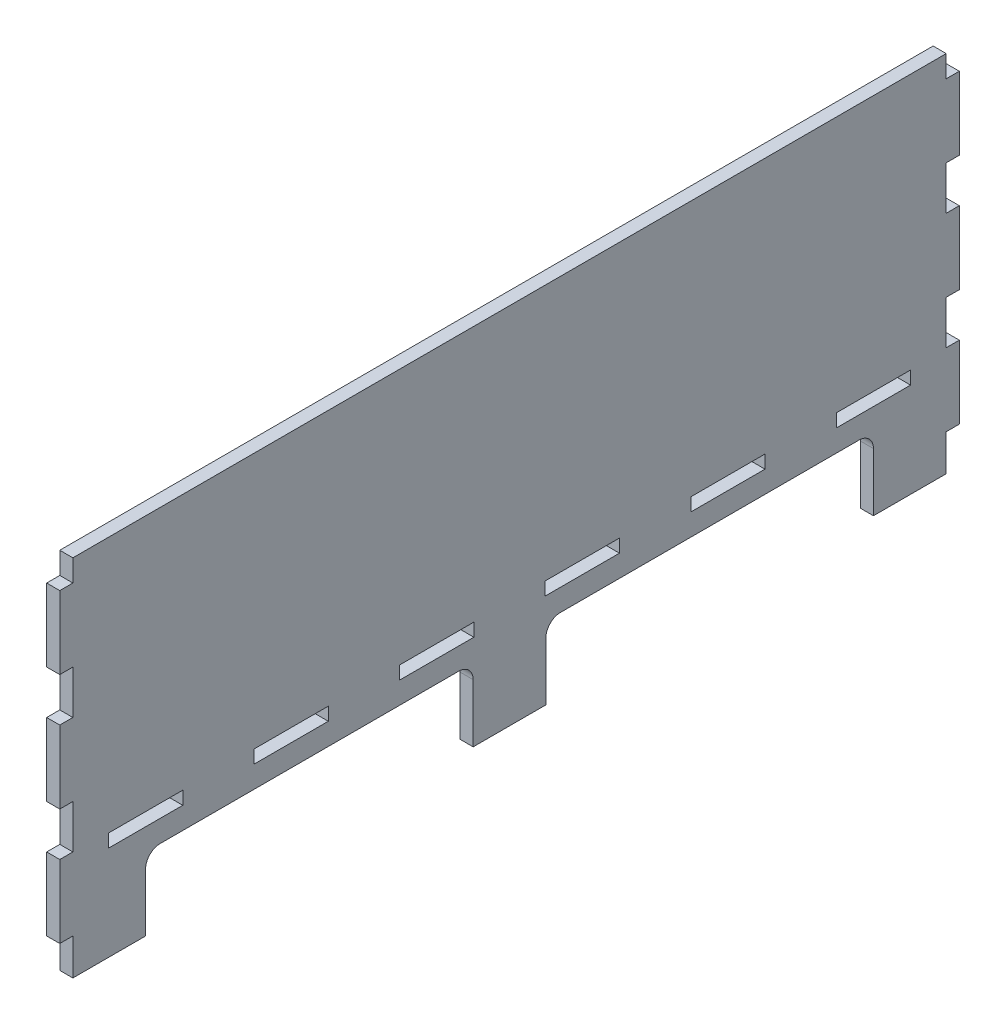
ISO-10303-21;
HEADER;
FILE_DESCRIPTION(('STEP AP214'),'2;1');
FILE_NAME('part.step','',(''),(''),'','','');
FILE_SCHEMA(('AUTOMOTIVE_DESIGN { 1 0 10303 214 1 1 1 1 }'));
ENDSEC;
DATA;
#1=APPLICATION_CONTEXT('core data for automotive mechanical design processes');
#2=APPLICATION_PROTOCOL_DEFINITION('international standard','automotive_design',2000,#1);
#3=PRODUCT_CONTEXT('',#1,'mechanical');
#4=PRODUCT('Part','Part','',(#3));
#5=PRODUCT_RELATED_PRODUCT_CATEGORY('part','',(#4));
#6=PRODUCT_DEFINITION_FORMATION('','',#4);
#7=PRODUCT_DEFINITION_CONTEXT('part definition',#1,'design');
#8=PRODUCT_DEFINITION('design','',#6,#7);
#9=PRODUCT_DEFINITION_SHAPE('','',#8);
#10=(LENGTH_UNIT() NAMED_UNIT(*) SI_UNIT(.MILLI.,.METRE.));
#11=(NAMED_UNIT(*) PLANE_ANGLE_UNIT() SI_UNIT($,.RADIAN.));
#12=(NAMED_UNIT(*) SI_UNIT($,.STERADIAN.) SOLID_ANGLE_UNIT());
#13=UNCERTAINTY_MEASURE_WITH_UNIT(LENGTH_MEASURE(1.E-05),#10,'distance_accuracy_value','');
#14=(GEOMETRIC_REPRESENTATION_CONTEXT(3) GLOBAL_UNCERTAINTY_ASSIGNED_CONTEXT((#13)) GLOBAL_UNIT_ASSIGNED_CONTEXT((#10,
#11,#12)) REPRESENTATION_CONTEXT('',''));
#15=CARTESIAN_POINT('',(0.,0.,0.));
#16=DIRECTION('',(0.,0.,1.));
#17=DIRECTION('',(1.,0.,0.));
#18=AXIS2_PLACEMENT_3D('',#15,#16,#17);
#19=CARTESIAN_POINT('',(0.,-224.332601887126,-224.5));
#20=DIRECTION('',(0.,-1.,0.));
#21=DIRECTION('',(0.,0.,-1.));
#22=AXIS2_PLACEMENT_3D('',#19,#20,#21);
#23=PLANE('',#22);
#24=DIRECTION('',(0.,0.,-1.));
#25=VECTOR('',#24,1.);
#26=CARTESIAN_POINT('',(9.,-224.332601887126,-224.5));
#27=LINE('',#26,#25);
#28=CARTESIAN_POINT('',(9.,-224.332601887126,-224.5));
#29=VERTEX_POINT('',#28);
#30=CARTESIAN_POINT('',(9.,-224.332601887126,-275.5));
#31=VERTEX_POINT('',#30);
#32=EDGE_CURVE('E896',#29,#31,#27,.T.);
#33=ORIENTED_EDGE('',*,*,#32,.T.);
#34=DIRECTION('',(1.,0.,0.));
#35=VECTOR('',#34,1.);
#36=CARTESIAN_POINT('',(0.,-224.332601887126,-275.5));
#37=LINE('',#36,#35);
#38=CARTESIAN_POINT('',(0.,-224.332601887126,-275.5));
#39=VERTEX_POINT('',#38);
#40=EDGE_CURVE('E11',#39,#31,#37,.T.);
#41=ORIENTED_EDGE('',*,*,#40,.F.);
#42=DIRECTION('',(0.,0.,-1.));
#43=VECTOR('',#42,1.);
#44=CARTESIAN_POINT('',(0.,-224.332601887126,-224.5));
#45=LINE('',#44,#43);
#46=CARTESIAN_POINT('',(0.,-224.332601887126,-224.5));
#47=VERTEX_POINT('',#46);
#48=EDGE_CURVE('E900',#47,#39,#45,.T.);
#49=ORIENTED_EDGE('',*,*,#48,.F.);
#50=DIRECTION('',(1.,0.,0.));
#51=VECTOR('',#50,1.);
#52=CARTESIAN_POINT('',(0.,-224.332601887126,-224.5));
#53=LINE('',#52,#51);
#54=EDGE_CURVE('E905',#47,#29,#53,.T.);
#55=ORIENTED_EDGE('',*,*,#54,.T.);
#56=EDGE_LOOP('',(#33,#41,#49,#55));
#57=FACE_BOUND('',#56,.T.);
#58=ADVANCED_FACE('F35',(#57),#23,.F.);
#59=CARTESIAN_POINT('',(0.,-215.332601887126,-275.5));
#60=DIRECTION('',(0.,0.,-1.));
#61=DIRECTION('',(-1.,0.,0.));
#62=AXIS2_PLACEMENT_3D('',#59,#60,#61);
#63=PLANE('',#62);
#64=DIRECTION('',(0.,1.,0.));
#65=VECTOR('',#64,1.);
#66=CARTESIAN_POINT('',(9.,-215.332601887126,-275.5));
#67=LINE('',#66,#65);
#68=CARTESIAN_POINT('',(9.,-215.332601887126,-275.5));
#69=VERTEX_POINT('',#68);
#70=EDGE_CURVE('E893',#31,#69,#67,.T.);
#71=ORIENTED_EDGE('',*,*,#70,.T.);
#72=DIRECTION('',(1.,0.,0.));
#73=VECTOR('',#72,1.);
#74=CARTESIAN_POINT('',(0.,-215.332601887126,-275.5));
#75=LINE('',#74,#73);
#76=CARTESIAN_POINT('',(0.,-215.332601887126,-275.5));
#77=VERTEX_POINT('',#76);
#78=EDGE_CURVE('E42',#77,#69,#75,.T.);
#79=ORIENTED_EDGE('',*,*,#78,.F.);
#80=DIRECTION('',(0.,1.,0.));
#81=VECTOR('',#80,1.);
#82=CARTESIAN_POINT('',(0.,-215.332601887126,-275.5));
#83=LINE('',#82,#81);
#84=EDGE_CURVE('E56',#39,#77,#83,.T.);
#85=ORIENTED_EDGE('',*,*,#84,.F.);
#86=ORIENTED_EDGE('',*,*,#40,.T.);
#87=EDGE_LOOP('',(#71,#79,#85,#86));
#88=FACE_BOUND('',#87,.T.);
#89=ADVANCED_FACE('F915',(#88),#63,.F.);
#90=CARTESIAN_POINT('',(0.,-215.332601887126,-224.5));
#91=DIRECTION('',(0.,1.,0.));
#92=DIRECTION('',(0.,0.,1.));
#93=AXIS2_PLACEMENT_3D('',#90,#91,#92);
#94=PLANE('',#93);
#95=DIRECTION('',(0.,0.,1.));
#96=VECTOR('',#95,1.);
#97=CARTESIAN_POINT('',(9.,-215.332601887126,-224.5));
#98=LINE('',#97,#96);
#99=CARTESIAN_POINT('',(9.,-215.332601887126,-224.5));
#100=VERTEX_POINT('',#99);
#101=EDGE_CURVE('E890',#69,#100,#98,.T.);
#102=ORIENTED_EDGE('',*,*,#101,.T.);
#103=DIRECTION('',(1.,0.,0.));
#104=VECTOR('',#103,1.);
#105=CARTESIAN_POINT('',(0.,-215.332601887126,-224.5));
#106=LINE('',#105,#104);
#107=CARTESIAN_POINT('',(0.,-215.332601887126,-224.5));
#108=VERTEX_POINT('',#107);
#109=EDGE_CURVE('E908',#108,#100,#106,.T.);
#110=ORIENTED_EDGE('',*,*,#109,.F.);
#111=DIRECTION('',(0.,0.,1.));
#112=VECTOR('',#111,1.);
#113=CARTESIAN_POINT('',(0.,-215.332601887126,-224.5));
#114=LINE('',#113,#112);
#115=EDGE_CURVE('E903',#77,#108,#114,.T.);
#116=ORIENTED_EDGE('',*,*,#115,.F.);
#117=ORIENTED_EDGE('',*,*,#78,.T.);
#118=EDGE_LOOP('',(#102,#110,#116,#117));
#119=FACE_BOUND('',#118,.T.);
#120=ADVANCED_FACE('F912',(#119),#94,.F.);
#121=CARTESIAN_POINT('',(0.,-215.332601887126,-224.5));
#122=DIRECTION('',(0.,0.,1.));
#123=DIRECTION('',(1.,0.,0.));
#124=AXIS2_PLACEMENT_3D('',#121,#122,#123);
#125=PLANE('',#124);
#126=DIRECTION('',(0.,-1.,0.));
#127=VECTOR('',#126,1.);
#128=CARTESIAN_POINT('',(9.,-215.332601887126,-224.5));
#129=LINE('',#128,#127);
#130=EDGE_CURVE('E888',#100,#29,#129,.T.);
#131=ORIENTED_EDGE('',*,*,#130,.T.);
#132=ORIENTED_EDGE('',*,*,#54,.F.);
#133=DIRECTION('',(0.,-1.,0.));
#134=VECTOR('',#133,1.);
#135=CARTESIAN_POINT('',(0.,-215.332601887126,-224.5));
#136=LINE('',#135,#134);
#137=EDGE_CURVE('E49',#108,#47,#136,.T.);
#138=ORIENTED_EDGE('',*,*,#137,.F.);
#139=ORIENTED_EDGE('',*,*,#109,.T.);
#140=EDGE_LOOP('',(#131,#132,#138,#139));
#141=FACE_BOUND('',#140,.T.);
#142=ADVANCED_FACE('F921',(#141),#125,.F.);
#143=CARTESIAN_POINT('',(0.,-224.332601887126,-124.5));
#144=DIRECTION('',(0.,-1.,0.));
#145=DIRECTION('',(0.,0.,-1.));
#146=AXIS2_PLACEMENT_3D('',#143,#144,#145);
#147=PLANE('',#146);
#148=DIRECTION('',(0.,0.,-1.));
#149=VECTOR('',#148,1.);
#150=CARTESIAN_POINT('',(9.,-224.332601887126,-124.5));
#151=LINE('',#150,#149);
#152=CARTESIAN_POINT('',(9.,-224.332601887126,-124.5));
#153=VERTEX_POINT('',#152);
#154=CARTESIAN_POINT('',(9.,-224.332601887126,-175.5));
#155=VERTEX_POINT('',#154);
#156=EDGE_CURVE('E864',#153,#155,#151,.T.);
#157=ORIENTED_EDGE('',*,*,#156,.T.);
#158=DIRECTION('',(1.,0.,0.));
#159=VECTOR('',#158,1.);
#160=CARTESIAN_POINT('',(0.,-224.332601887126,-175.5));
#161=LINE('',#160,#159);
#162=CARTESIAN_POINT('',(0.,-224.332601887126,-175.5));
#163=VERTEX_POINT('',#162);
#164=EDGE_CURVE('E885',#163,#155,#161,.T.);
#165=ORIENTED_EDGE('',*,*,#164,.F.);
#166=DIRECTION('',(0.,0.,-1.));
#167=VECTOR('',#166,1.);
#168=CARTESIAN_POINT('',(0.,-224.332601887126,-124.5));
#169=LINE('',#168,#167);
#170=CARTESIAN_POINT('',(0.,-224.332601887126,-124.5));
#171=VERTEX_POINT('',#170);
#172=EDGE_CURVE('E869',#171,#163,#169,.T.);
#173=ORIENTED_EDGE('',*,*,#172,.F.);
#174=DIRECTION('',(1.,0.,0.));
#175=VECTOR('',#174,1.);
#176=CARTESIAN_POINT('',(0.,-224.332601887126,-124.5));
#177=LINE('',#176,#175);
#178=EDGE_CURVE('E876',#171,#153,#177,.T.);
#179=ORIENTED_EDGE('',*,*,#178,.T.);
#180=EDGE_LOOP('',(#157,#165,#173,#179));
#181=FACE_BOUND('',#180,.T.);
#182=ADVANCED_FACE('F923',(#181),#147,.F.);
#183=CARTESIAN_POINT('',(0.,-215.332601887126,-175.5));
#184=DIRECTION('',(0.,0.,-1.));
#185=DIRECTION('',(-1.,0.,0.));
#186=AXIS2_PLACEMENT_3D('',#183,#184,#185);
#187=PLANE('',#186);
#188=DIRECTION('',(0.,1.,0.));
#189=VECTOR('',#188,1.);
#190=CARTESIAN_POINT('',(9.,-215.332601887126,-175.5));
#191=LINE('',#190,#189);
#192=CARTESIAN_POINT('',(9.,-215.332601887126,-175.5));
#193=VERTEX_POINT('',#192);
#194=EDGE_CURVE('E861',#155,#193,#191,.T.);
#195=ORIENTED_EDGE('',*,*,#194,.T.);
#196=DIRECTION('',(1.,0.,0.));
#197=VECTOR('',#196,1.);
#198=CARTESIAN_POINT('',(0.,-215.332601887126,-175.5));
#199=LINE('',#198,#197);
#200=CARTESIAN_POINT('',(0.,-215.332601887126,-175.5));
#201=VERTEX_POINT('',#200);
#202=EDGE_CURVE('E882',#201,#193,#199,.T.);
#203=ORIENTED_EDGE('',*,*,#202,.F.);
#204=DIRECTION('',(0.,1.,0.));
#205=VECTOR('',#204,1.);
#206=CARTESIAN_POINT('',(0.,-215.332601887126,-175.5));
#207=LINE('',#206,#205);
#208=EDGE_CURVE('E871',#163,#201,#207,.T.);
#209=ORIENTED_EDGE('',*,*,#208,.F.);
#210=ORIENTED_EDGE('',*,*,#164,.T.);
#211=EDGE_LOOP('',(#195,#203,#209,#210));
#212=FACE_BOUND('',#211,.T.);
#213=ADVANCED_FACE('F929',(#212),#187,.F.);
#214=CARTESIAN_POINT('',(0.,-215.332601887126,-124.5));
#215=DIRECTION('',(0.,1.,0.));
#216=DIRECTION('',(0.,0.,1.));
#217=AXIS2_PLACEMENT_3D('',#214,#215,#216);
#218=PLANE('',#217);
#219=DIRECTION('',(0.,0.,1.));
#220=VECTOR('',#219,1.);
#221=CARTESIAN_POINT('',(9.,-215.332601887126,-124.5));
#222=LINE('',#221,#220);
#223=CARTESIAN_POINT('',(9.,-215.332601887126,-124.5));
#224=VERTEX_POINT('',#223);
#225=EDGE_CURVE('E858',#193,#224,#222,.T.);
#226=ORIENTED_EDGE('',*,*,#225,.T.);
#227=DIRECTION('',(1.,0.,0.));
#228=VECTOR('',#227,1.);
#229=CARTESIAN_POINT('',(0.,-215.332601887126,-124.5));
#230=LINE('',#229,#228);
#231=CARTESIAN_POINT('',(0.,-215.332601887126,-124.5));
#232=VERTEX_POINT('',#231);
#233=EDGE_CURVE('E879',#232,#224,#230,.T.);
#234=ORIENTED_EDGE('',*,*,#233,.F.);
#235=DIRECTION('',(0.,0.,1.));
#236=VECTOR('',#235,1.);
#237=CARTESIAN_POINT('',(0.,-215.332601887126,-124.5));
#238=LINE('',#237,#236);
#239=EDGE_CURVE('E873',#201,#232,#238,.T.);
#240=ORIENTED_EDGE('',*,*,#239,.F.);
#241=ORIENTED_EDGE('',*,*,#202,.T.);
#242=EDGE_LOOP('',(#226,#234,#240,#241));
#243=FACE_BOUND('',#242,.T.);
#244=ADVANCED_FACE('F962',(#243),#218,.F.);
#245=CARTESIAN_POINT('',(0.,-215.332601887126,-124.5));
#246=DIRECTION('',(0.,0.,1.));
#247=DIRECTION('',(1.,0.,0.));
#248=AXIS2_PLACEMENT_3D('',#245,#246,#247);
#249=PLANE('',#248);
#250=DIRECTION('',(0.,-1.,0.));
#251=VECTOR('',#250,1.);
#252=CARTESIAN_POINT('',(9.,-215.332601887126,-124.5));
#253=LINE('',#252,#251);
#254=EDGE_CURVE('E856',#224,#153,#253,.T.);
#255=ORIENTED_EDGE('',*,*,#254,.T.);
#256=ORIENTED_EDGE('',*,*,#178,.F.);
#257=DIRECTION('',(0.,-1.,0.));
#258=VECTOR('',#257,1.);
#259=CARTESIAN_POINT('',(0.,-215.332601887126,-124.5));
#260=LINE('',#259,#258);
#261=EDGE_CURVE('E867',#232,#171,#260,.T.);
#262=ORIENTED_EDGE('',*,*,#261,.F.);
#263=ORIENTED_EDGE('',*,*,#233,.T.);
#264=EDGE_LOOP('',(#255,#256,#262,#263));
#265=FACE_BOUND('',#264,.T.);
#266=ADVANCED_FACE('F972',(#265),#249,.F.);
#267=CARTESIAN_POINT('',(0.,-224.332601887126,-24.5000000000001));
#268=DIRECTION('',(0.,-1.,0.));
#269=DIRECTION('',(0.,0.,-1.));
#270=AXIS2_PLACEMENT_3D('',#267,#268,#269);
#271=PLANE('',#270);
#272=DIRECTION('',(0.,0.,-1.));
#273=VECTOR('',#272,1.);
#274=CARTESIAN_POINT('',(9.,-224.332601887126,-24.5000000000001));
#275=LINE('',#274,#273);
#276=CARTESIAN_POINT('',(9.,-224.332601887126,-24.5000000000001));
#277=VERTEX_POINT('',#276);
#278=CARTESIAN_POINT('',(9.,-224.332601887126,-75.5000000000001));
#279=VERTEX_POINT('',#278);
#280=EDGE_CURVE('E832',#277,#279,#275,.T.);
#281=ORIENTED_EDGE('',*,*,#280,.T.);
#282=DIRECTION('',(1.,0.,0.));
#283=VECTOR('',#282,1.);
#284=CARTESIAN_POINT('',(0.,-224.332601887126,-75.5000000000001));
#285=LINE('',#284,#283);
#286=CARTESIAN_POINT('',(0.,-224.332601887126,-75.5000000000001));
#287=VERTEX_POINT('',#286);
#288=EDGE_CURVE('E853',#287,#279,#285,.T.);
#289=ORIENTED_EDGE('',*,*,#288,.F.);
#290=DIRECTION('',(0.,0.,-1.));
#291=VECTOR('',#290,1.);
#292=CARTESIAN_POINT('',(0.,-224.332601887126,-24.5000000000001));
#293=LINE('',#292,#291);
#294=CARTESIAN_POINT('',(0.,-224.332601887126,-24.5000000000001));
#295=VERTEX_POINT('',#294);
#296=EDGE_CURVE('E837',#295,#287,#293,.T.);
#297=ORIENTED_EDGE('',*,*,#296,.F.);
#298=DIRECTION('',(1.,0.,0.));
#299=VECTOR('',#298,1.);
#300=CARTESIAN_POINT('',(0.,-224.332601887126,-24.5000000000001));
#301=LINE('',#300,#299);
#302=EDGE_CURVE('E844',#295,#277,#301,.T.);
#303=ORIENTED_EDGE('',*,*,#302,.T.);
#304=EDGE_LOOP('',(#281,#289,#297,#303));
#305=FACE_BOUND('',#304,.T.);
#306=ADVANCED_FACE('F982',(#305),#271,.F.);
#307=CARTESIAN_POINT('',(0.,-215.332601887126,-75.5000000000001));
#308=DIRECTION('',(0.,0.,-1.));
#309=DIRECTION('',(-1.,0.,0.));
#310=AXIS2_PLACEMENT_3D('',#307,#308,#309);
#311=PLANE('',#310);
#312=DIRECTION('',(0.,1.,0.));
#313=VECTOR('',#312,1.);
#314=CARTESIAN_POINT('',(9.,-215.332601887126,-75.5000000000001));
#315=LINE('',#314,#313);
#316=CARTESIAN_POINT('',(9.,-215.332601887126,-75.5000000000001));
#317=VERTEX_POINT('',#316);
#318=EDGE_CURVE('E829',#279,#317,#315,.T.);
#319=ORIENTED_EDGE('',*,*,#318,.T.);
#320=DIRECTION('',(1.,0.,0.));
#321=VECTOR('',#320,1.);
#322=CARTESIAN_POINT('',(0.,-215.332601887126,-75.5000000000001));
#323=LINE('',#322,#321);
#324=CARTESIAN_POINT('',(0.,-215.332601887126,-75.5000000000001));
#325=VERTEX_POINT('',#324);
#326=EDGE_CURVE('E850',#325,#317,#323,.T.);
#327=ORIENTED_EDGE('',*,*,#326,.F.);
#328=DIRECTION('',(0.,1.,0.));
#329=VECTOR('',#328,1.);
#330=CARTESIAN_POINT('',(0.,-215.332601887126,-75.5000000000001));
#331=LINE('',#330,#329);
#332=EDGE_CURVE('E839',#287,#325,#331,.T.);
#333=ORIENTED_EDGE('',*,*,#332,.F.);
#334=ORIENTED_EDGE('',*,*,#288,.T.);
#335=EDGE_LOOP('',(#319,#327,#333,#334));
#336=FACE_BOUND('',#335,.T.);
#337=ADVANCED_FACE('F992',(#336),#311,.F.);
#338=CARTESIAN_POINT('',(0.,-215.332601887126,-24.5000000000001));
#339=DIRECTION('',(0.,1.,0.));
#340=DIRECTION('',(0.,0.,1.));
#341=AXIS2_PLACEMENT_3D('',#338,#339,#340);
#342=PLANE('',#341);
#343=DIRECTION('',(0.,0.,1.));
#344=VECTOR('',#343,1.);
#345=CARTESIAN_POINT('',(9.,-215.332601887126,-24.5000000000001));
#346=LINE('',#345,#344);
#347=CARTESIAN_POINT('',(9.,-215.332601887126,-24.5000000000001));
#348=VERTEX_POINT('',#347);
#349=EDGE_CURVE('E826',#317,#348,#346,.T.);
#350=ORIENTED_EDGE('',*,*,#349,.T.);
#351=DIRECTION('',(1.,0.,0.));
#352=VECTOR('',#351,1.);
#353=CARTESIAN_POINT('',(0.,-215.332601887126,-24.5000000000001));
#354=LINE('',#353,#352);
#355=CARTESIAN_POINT('',(0.,-215.332601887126,-24.5000000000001));
#356=VERTEX_POINT('',#355);
#357=EDGE_CURVE('E847',#356,#348,#354,.T.);
#358=ORIENTED_EDGE('',*,*,#357,.F.);
#359=DIRECTION('',(0.,0.,1.));
#360=VECTOR('',#359,1.);
#361=CARTESIAN_POINT('',(0.,-215.332601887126,-24.5000000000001));
#362=LINE('',#361,#360);
#363=EDGE_CURVE('E841',#325,#356,#362,.T.);
#364=ORIENTED_EDGE('',*,*,#363,.F.);
#365=ORIENTED_EDGE('',*,*,#326,.T.);
#366=EDGE_LOOP('',(#350,#358,#364,#365));
#367=FACE_BOUND('',#366,.T.);
#368=ADVANCED_FACE('F1002',(#367),#342,.F.);
#369=CARTESIAN_POINT('',(0.,-215.332601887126,-24.5000000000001));
#370=DIRECTION('',(0.,0.,1.));
#371=DIRECTION('',(1.,0.,0.));
#372=AXIS2_PLACEMENT_3D('',#369,#370,#371);
#373=PLANE('',#372);
#374=DIRECTION('',(0.,-1.,0.));
#375=VECTOR('',#374,1.);
#376=CARTESIAN_POINT('',(9.,-215.332601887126,-24.5000000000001));
#377=LINE('',#376,#375);
#378=EDGE_CURVE('E824',#348,#277,#377,.T.);
#379=ORIENTED_EDGE('',*,*,#378,.T.);
#380=ORIENTED_EDGE('',*,*,#302,.F.);
#381=DIRECTION('',(0.,-1.,0.));
#382=VECTOR('',#381,1.);
#383=CARTESIAN_POINT('',(0.,-215.332601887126,-24.5000000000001));
#384=LINE('',#383,#382);
#385=EDGE_CURVE('E835',#356,#295,#384,.T.);
#386=ORIENTED_EDGE('',*,*,#385,.F.);
#387=ORIENTED_EDGE('',*,*,#357,.T.);
#388=EDGE_LOOP('',(#379,#380,#386,#387));
#389=FACE_BOUND('',#388,.T.);
#390=ADVANCED_FACE('F1012',(#389),#373,.F.);
#391=CARTESIAN_POINT('',(0.,-224.332601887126,75.5));
#392=DIRECTION('',(0.,-1.,0.));
#393=DIRECTION('',(0.,0.,-1.));
#394=AXIS2_PLACEMENT_3D('',#391,#392,#393);
#395=PLANE('',#394);
#396=DIRECTION('',(0.,0.,-1.));
#397=VECTOR('',#396,1.);
#398=CARTESIAN_POINT('',(9.,-224.332601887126,75.5));
#399=LINE('',#398,#397);
#400=CARTESIAN_POINT('',(9.,-224.332601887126,75.5));
#401=VERTEX_POINT('',#400);
#402=CARTESIAN_POINT('',(9.,-224.332601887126,24.5));
#403=VERTEX_POINT('',#402);
#404=EDGE_CURVE('E800',#401,#403,#399,.T.);
#405=ORIENTED_EDGE('',*,*,#404,.T.);
#406=DIRECTION('',(1.,0.,0.));
#407=VECTOR('',#406,1.);
#408=CARTESIAN_POINT('',(0.,-224.332601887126,24.5));
#409=LINE('',#408,#407);
#410=CARTESIAN_POINT('',(0.,-224.332601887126,24.5));
#411=VERTEX_POINT('',#410);
#412=EDGE_CURVE('E821',#411,#403,#409,.T.);
#413=ORIENTED_EDGE('',*,*,#412,.F.);
#414=DIRECTION('',(0.,0.,-1.));
#415=VECTOR('',#414,1.);
#416=CARTESIAN_POINT('',(0.,-224.332601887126,75.5));
#417=LINE('',#416,#415);
#418=CARTESIAN_POINT('',(0.,-224.332601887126,75.5));
#419=VERTEX_POINT('',#418);
#420=EDGE_CURVE('E805',#419,#411,#417,.T.);
#421=ORIENTED_EDGE('',*,*,#420,.F.);
#422=DIRECTION('',(1.,0.,0.));
#423=VECTOR('',#422,1.);
#424=CARTESIAN_POINT('',(0.,-224.332601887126,75.5));
#425=LINE('',#424,#423);
#426=EDGE_CURVE('E812',#419,#401,#425,.T.);
#427=ORIENTED_EDGE('',*,*,#426,.T.);
#428=EDGE_LOOP('',(#405,#413,#421,#427));
#429=FACE_BOUND('',#428,.T.);
#430=ADVANCED_FACE('F1022',(#429),#395,.F.);
#431=CARTESIAN_POINT('',(0.,-215.332601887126,24.5));
#432=DIRECTION('',(0.,0.,-1.));
#433=DIRECTION('',(-1.,0.,0.));
#434=AXIS2_PLACEMENT_3D('',#431,#432,#433);
#435=PLANE('',#434);
#436=DIRECTION('',(0.,1.,0.));
#437=VECTOR('',#436,1.);
#438=CARTESIAN_POINT('',(9.,-215.332601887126,24.5));
#439=LINE('',#438,#437);
#440=CARTESIAN_POINT('',(9.,-215.332601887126,24.5));
#441=VERTEX_POINT('',#440);
#442=EDGE_CURVE('E797',#403,#441,#439,.T.);
#443=ORIENTED_EDGE('',*,*,#442,.T.);
#444=DIRECTION('',(1.,0.,0.));
#445=VECTOR('',#444,1.);
#446=CARTESIAN_POINT('',(0.,-215.332601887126,24.5));
#447=LINE('',#446,#445);
#448=CARTESIAN_POINT('',(0.,-215.332601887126,24.5));
#449=VERTEX_POINT('',#448);
#450=EDGE_CURVE('E818',#449,#441,#447,.T.);
#451=ORIENTED_EDGE('',*,*,#450,.F.);
#452=DIRECTION('',(0.,1.,0.));
#453=VECTOR('',#452,1.);
#454=CARTESIAN_POINT('',(0.,-215.332601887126,24.5));
#455=LINE('',#454,#453);
#456=EDGE_CURVE('E807',#411,#449,#455,.T.);
#457=ORIENTED_EDGE('',*,*,#456,.F.);
#458=ORIENTED_EDGE('',*,*,#412,.T.);
#459=EDGE_LOOP('',(#443,#451,#457,#458));
#460=FACE_BOUND('',#459,.T.);
#461=ADVANCED_FACE('F1032',(#460),#435,.F.);
#462=CARTESIAN_POINT('',(0.,-215.332601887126,75.5));
#463=DIRECTION('',(0.,1.,0.));
#464=DIRECTION('',(0.,0.,1.));
#465=AXIS2_PLACEMENT_3D('',#462,#463,#464);
#466=PLANE('',#465);
#467=DIRECTION('',(0.,0.,1.));
#468=VECTOR('',#467,1.);
#469=CARTESIAN_POINT('',(9.,-215.332601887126,75.5));
#470=LINE('',#469,#468);
#471=CARTESIAN_POINT('',(9.,-215.332601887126,75.5));
#472=VERTEX_POINT('',#471);
#473=EDGE_CURVE('E794',#441,#472,#470,.T.);
#474=ORIENTED_EDGE('',*,*,#473,.T.);
#475=DIRECTION('',(1.,0.,0.));
#476=VECTOR('',#475,1.);
#477=CARTESIAN_POINT('',(0.,-215.332601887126,75.5));
#478=LINE('',#477,#476);
#479=CARTESIAN_POINT('',(0.,-215.332601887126,75.5));
#480=VERTEX_POINT('',#479);
#481=EDGE_CURVE('E815',#480,#472,#478,.T.);
#482=ORIENTED_EDGE('',*,*,#481,.F.);
#483=DIRECTION('',(0.,0.,1.));
#484=VECTOR('',#483,1.);
#485=CARTESIAN_POINT('',(0.,-215.332601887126,75.5));
#486=LINE('',#485,#484);
#487=EDGE_CURVE('E809',#449,#480,#486,.T.);
#488=ORIENTED_EDGE('',*,*,#487,.F.);
#489=ORIENTED_EDGE('',*,*,#450,.T.);
#490=EDGE_LOOP('',(#474,#482,#488,#489));
#491=FACE_BOUND('',#490,.T.);
#492=ADVANCED_FACE('F1042',(#491),#466,.F.);
#493=CARTESIAN_POINT('',(0.,-215.332601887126,75.5));
#494=DIRECTION('',(0.,0.,1.));
#495=DIRECTION('',(1.,0.,0.));
#496=AXIS2_PLACEMENT_3D('',#493,#494,#495);
#497=PLANE('',#496);
#498=DIRECTION('',(0.,-1.,0.));
#499=VECTOR('',#498,1.);
#500=CARTESIAN_POINT('',(9.,-215.332601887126,75.5));
#501=LINE('',#500,#499);
#502=EDGE_CURVE('E792',#472,#401,#501,.T.);
#503=ORIENTED_EDGE('',*,*,#502,.T.);
#504=ORIENTED_EDGE('',*,*,#426,.F.);
#505=DIRECTION('',(0.,-1.,0.));
#506=VECTOR('',#505,1.);
#507=CARTESIAN_POINT('',(0.,-215.332601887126,75.5));
#508=LINE('',#507,#506);
#509=EDGE_CURVE('E803',#480,#419,#508,.T.);
#510=ORIENTED_EDGE('',*,*,#509,.F.);
#511=ORIENTED_EDGE('',*,*,#481,.T.);
#512=EDGE_LOOP('',(#503,#504,#510,#511));
#513=FACE_BOUND('',#512,.T.);
#514=ADVANCED_FACE('F1052',(#513),#497,.F.);
#515=CARTESIAN_POINT('',(9.,-39.3326018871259,300.));
#516=DIRECTION('',(0.,0.,-1.));
#517=DIRECTION('',(0.,1.,0.));
#518=AXIS2_PLACEMENT_3D('',#515,#516,#517);
#519=PLANE('',#518);
#520=DIRECTION('',(0.,-1.,0.));
#521=VECTOR('',#520,1.);
#522=CARTESIAN_POINT('',(0.,-39.3326018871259,300.));
#523=LINE('',#522,#521);
#524=CARTESIAN_POINT('',(0.,-39.3326018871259,300.));
#525=VERTEX_POINT('',#524);
#526=CARTESIAN_POINT('',(0.,-54.3326018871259,300.000000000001));
#527=VERTEX_POINT('',#526);
#528=EDGE_CURVE('E504',#525,#527,#523,.T.);
#529=ORIENTED_EDGE('',*,*,#528,.T.);
#530=DIRECTION('',(-1.,0.,0.));
#531=VECTOR('',#530,1.);
#532=CARTESIAN_POINT('',(9.,-54.3326018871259,300.000000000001));
#533=LINE('',#532,#531);
#534=CARTESIAN_POINT('',(9.,-54.3326018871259,300.000000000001));
#535=VERTEX_POINT('',#534);
#536=EDGE_CURVE('E789',#535,#527,#533,.T.);
#537=ORIENTED_EDGE('',*,*,#536,.F.);
#538=DIRECTION('',(0.,-1.,0.));
#539=VECTOR('',#538,1.);
#540=CARTESIAN_POINT('',(9.,-39.3326018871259,300.));
#541=LINE('',#540,#539);
#542=CARTESIAN_POINT('',(9.,-39.3326018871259,300.));
#543=VERTEX_POINT('',#542);
#544=EDGE_CURVE('E511',#543,#535,#541,.T.);
#545=ORIENTED_EDGE('',*,*,#544,.F.);
#546=DIRECTION('',(-1.,0.,0.));
#547=VECTOR('',#546,1.);
#548=CARTESIAN_POINT('',(9.,-39.3326018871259,300.));
#549=LINE('',#548,#547);
#550=EDGE_CURVE('E593',#543,#525,#549,.T.);
#551=ORIENTED_EDGE('',*,*,#550,.T.);
#552=EDGE_LOOP('',(#529,#537,#545,#551));
#553=FACE_BOUND('',#552,.T.);
#554=ADVANCED_FACE('F1062',(#553),#519,.F.);
#555=CARTESIAN_POINT('',(9.,-54.3326018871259,309.000000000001));
#556=DIRECTION('',(0.,-1.,0.));
#557=DIRECTION('',(0.,0.,-1.));
#558=AXIS2_PLACEMENT_3D('',#555,#556,#557);
#559=PLANE('',#558);
#560=DIRECTION('',(0.,0.,1.));
#561=VECTOR('',#560,1.);
#562=CARTESIAN_POINT('',(0.,-54.3326018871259,309.000000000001));
#563=LINE('',#562,#561);
#564=CARTESIAN_POINT('',(0.,-54.3326018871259,309.000000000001));
#565=VERTEX_POINT('',#564);
#566=EDGE_CURVE('E596',#527,#565,#563,.T.);
#567=ORIENTED_EDGE('',*,*,#566,.T.);
#568=DIRECTION('',(-1.,0.,0.));
#569=VECTOR('',#568,1.);
#570=CARTESIAN_POINT('',(9.,-54.3326018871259,309.000000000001));
#571=LINE('',#570,#569);
#572=CARTESIAN_POINT('',(9.,-54.3326018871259,309.000000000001));
#573=VERTEX_POINT('',#572);
#574=EDGE_CURVE('E786',#573,#565,#571,.T.);
#575=ORIENTED_EDGE('',*,*,#574,.F.);
#576=DIRECTION('',(0.,0.,1.));
#577=VECTOR('',#576,1.);
#578=CARTESIAN_POINT('',(9.,-54.3326018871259,309.000000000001));
#579=LINE('',#578,#577);
#580=EDGE_CURVE('E514',#535,#573,#579,.T.);
#581=ORIENTED_EDGE('',*,*,#580,.F.);
#582=ORIENTED_EDGE('',*,*,#536,.T.);
#583=EDGE_LOOP('',(#567,#575,#581,#582));
#584=FACE_BOUND('',#583,.T.);
#585=ADVANCED_FACE('F1292',(#584),#559,.F.);
#586=CARTESIAN_POINT('',(9.,-104.332601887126,309.000000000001));
#587=DIRECTION('',(0.,0.,-1.));
#588=DIRECTION('',(-1.,0.,0.));
#589=AXIS2_PLACEMENT_3D('',#586,#587,#588);
#590=PLANE('',#589);
#591=DIRECTION('',(0.,-1.,0.));
#592=VECTOR('',#591,1.);
#593=CARTESIAN_POINT('',(0.,-104.332601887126,309.000000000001));
#594=LINE('',#593,#592);
#595=CARTESIAN_POINT('',(0.,-104.332601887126,309.000000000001));
#596=VERTEX_POINT('',#595);
#597=EDGE_CURVE('E598',#565,#596,#594,.T.);
#598=ORIENTED_EDGE('',*,*,#597,.T.);
#599=DIRECTION('',(-1.,0.,0.));
#600=VECTOR('',#599,1.);
#601=CARTESIAN_POINT('',(9.,-104.332601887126,309.000000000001));
#602=LINE('',#601,#600);
#603=CARTESIAN_POINT('',(9.,-104.332601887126,309.000000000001));
#604=VERTEX_POINT('',#603);
#605=EDGE_CURVE('E783',#604,#596,#602,.T.);
#606=ORIENTED_EDGE('',*,*,#605,.F.);
#607=DIRECTION('',(0.,-1.,0.));
#608=VECTOR('',#607,1.);
#609=CARTESIAN_POINT('',(9.,-104.332601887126,309.000000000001));
#610=LINE('',#609,#608);
#611=EDGE_CURVE('E517',#573,#604,#610,.T.);
#612=ORIENTED_EDGE('',*,*,#611,.F.);
#613=ORIENTED_EDGE('',*,*,#574,.T.);
#614=EDGE_LOOP('',(#598,#606,#612,#613));
#615=FACE_BOUND('',#614,.T.);
#616=ADVANCED_FACE('F1288',(#615),#590,.F.);
#617=CARTESIAN_POINT('',(9.,-104.332601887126,300.000000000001));
#618=DIRECTION('',(0.,1.,0.));
#619=DIRECTION('',(0.,0.,1.));
#620=AXIS2_PLACEMENT_3D('',#617,#618,#619);
#621=PLANE('',#620);
#622=DIRECTION('',(0.,0.,-1.));
#623=VECTOR('',#622,1.);
#624=CARTESIAN_POINT('',(0.,-104.332601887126,300.000000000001));
#625=LINE('',#624,#623);
#626=CARTESIAN_POINT('',(0.,-104.332601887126,300.000000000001));
#627=VERTEX_POINT('',#626);
#628=EDGE_CURVE('E600',#596,#627,#625,.T.);
#629=ORIENTED_EDGE('',*,*,#628,.T.);
#630=DIRECTION('',(-1.,0.,0.));
#631=VECTOR('',#630,1.);
#632=CARTESIAN_POINT('',(9.,-104.332601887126,300.000000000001));
#633=LINE('',#632,#631);
#634=CARTESIAN_POINT('',(9.,-104.332601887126,300.000000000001));
#635=VERTEX_POINT('',#634);
#636=EDGE_CURVE('E780',#635,#627,#633,.T.);
#637=ORIENTED_EDGE('',*,*,#636,.F.);
#638=DIRECTION('',(0.,0.,-1.));
#639=VECTOR('',#638,1.);
#640=CARTESIAN_POINT('',(9.,-104.332601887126,300.000000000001));
#641=LINE('',#640,#639);
#642=EDGE_CURVE('E519',#604,#635,#641,.T.);
#643=ORIENTED_EDGE('',*,*,#642,.F.);
#644=ORIENTED_EDGE('',*,*,#605,.T.);
#645=EDGE_LOOP('',(#629,#637,#643,#644));
#646=FACE_BOUND('',#645,.T.);
#647=ADVANCED_FACE('F1284',(#646),#621,.F.);
#648=CARTESIAN_POINT('',(9.,-104.332601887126,300.000000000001));
#649=DIRECTION('',(0.,0.,-1.));
#650=DIRECTION('',(0.,1.,0.));
#651=AXIS2_PLACEMENT_3D('',#648,#649,#650);
#652=PLANE('',#651);
#653=DIRECTION('',(0.,-1.,0.));
#654=VECTOR('',#653,1.);
#655=CARTESIAN_POINT('',(0.,-104.332601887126,300.000000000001));
#656=LINE('',#655,#654);
#657=CARTESIAN_POINT('',(0.,-134.332601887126,300.));
#658=VERTEX_POINT('',#657);
#659=EDGE_CURVE('E602',#627,#658,#656,.T.);
#660=ORIENTED_EDGE('',*,*,#659,.T.);
#661=DIRECTION('',(-1.,0.,0.));
#662=VECTOR('',#661,1.);
#663=CARTESIAN_POINT('',(9.,-134.332601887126,300.));
#664=LINE('',#663,#662);
#665=CARTESIAN_POINT('',(9.,-134.332601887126,300.));
#666=VERTEX_POINT('',#665);
#667=EDGE_CURVE('E777',#666,#658,#664,.T.);
#668=ORIENTED_EDGE('',*,*,#667,.F.);
#669=DIRECTION('',(0.,-1.,0.));
#670=VECTOR('',#669,1.);
#671=CARTESIAN_POINT('',(9.,-104.332601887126,300.000000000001));
#672=LINE('',#671,#670);
#673=EDGE_CURVE('E521',#635,#666,#672,.T.);
#674=ORIENTED_EDGE('',*,*,#673,.F.);
#675=ORIENTED_EDGE('',*,*,#636,.T.);
#676=EDGE_LOOP('',(#660,#668,#674,#675));
#677=FACE_BOUND('',#676,.T.);
#678=ADVANCED_FACE('F1280',(#677),#652,.F.);
#679=CARTESIAN_POINT('',(9.,-134.332601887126,309.));
#680=DIRECTION('',(0.,-1.,0.));
#681=DIRECTION('',(0.,0.,-1.));
#682=AXIS2_PLACEMENT_3D('',#679,#680,#681);
#683=PLANE('',#682);
#684=DIRECTION('',(0.,0.,1.));
#685=VECTOR('',#684,1.);
#686=CARTESIAN_POINT('',(0.,-134.332601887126,309.));
#687=LINE('',#686,#685);
#688=CARTESIAN_POINT('',(0.,-134.332601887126,309.));
#689=VERTEX_POINT('',#688);
#690=EDGE_CURVE('E604',#658,#689,#687,.T.);
#691=ORIENTED_EDGE('',*,*,#690,.T.);
#692=DIRECTION('',(-1.,0.,0.));
#693=VECTOR('',#692,1.);
#694=CARTESIAN_POINT('',(9.,-134.332601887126,309.));
#695=LINE('',#694,#693);
#696=CARTESIAN_POINT('',(9.,-134.332601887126,309.));
#697=VERTEX_POINT('',#696);
#698=EDGE_CURVE('E774',#697,#689,#695,.T.);
#699=ORIENTED_EDGE('',*,*,#698,.F.);
#700=DIRECTION('',(0.,0.,1.));
#701=VECTOR('',#700,1.);
#702=CARTESIAN_POINT('',(9.,-134.332601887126,309.));
#703=LINE('',#702,#701);
#704=EDGE_CURVE('E523',#666,#697,#703,.T.);
#705=ORIENTED_EDGE('',*,*,#704,.F.);
#706=ORIENTED_EDGE('',*,*,#667,.T.);
#707=EDGE_LOOP('',(#691,#699,#705,#706));
#708=FACE_BOUND('',#707,.T.);
#709=ADVANCED_FACE('F1276',(#708),#683,.F.);
#710=CARTESIAN_POINT('',(9.,-184.332601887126,309.));
#711=DIRECTION('',(0.,0.,-1.));
#712=DIRECTION('',(-1.,0.,0.));
#713=AXIS2_PLACEMENT_3D('',#710,#711,#712);
#714=PLANE('',#713);
#715=DIRECTION('',(0.,-1.,0.));
#716=VECTOR('',#715,1.);
#717=CARTESIAN_POINT('',(0.,-184.332601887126,309.));
#718=LINE('',#717,#716);
#719=CARTESIAN_POINT('',(0.,-184.332601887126,309.));
#720=VERTEX_POINT('',#719);
#721=EDGE_CURVE('E606',#689,#720,#718,.T.);
#722=ORIENTED_EDGE('',*,*,#721,.T.);
#723=DIRECTION('',(-1.,0.,0.));
#724=VECTOR('',#723,1.);
#725=CARTESIAN_POINT('',(9.,-184.332601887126,309.));
#726=LINE('',#725,#724);
#727=CARTESIAN_POINT('',(9.,-184.332601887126,309.));
#728=VERTEX_POINT('',#727);
#729=EDGE_CURVE('E771',#728,#720,#726,.T.);
#730=ORIENTED_EDGE('',*,*,#729,.F.);
#731=DIRECTION('',(0.,-1.,0.));
#732=VECTOR('',#731,1.);
#733=CARTESIAN_POINT('',(9.,-184.332601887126,309.));
#734=LINE('',#733,#732);
#735=EDGE_CURVE('E525',#697,#728,#734,.T.);
#736=ORIENTED_EDGE('',*,*,#735,.F.);
#737=ORIENTED_EDGE('',*,*,#698,.T.);
#738=EDGE_LOOP('',(#722,#730,#736,#737));
#739=FACE_BOUND('',#738,.T.);
#740=ADVANCED_FACE('F1272',(#739),#714,.F.);
#741=CARTESIAN_POINT('',(9.,-184.332601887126,300.));
#742=DIRECTION('',(0.,1.,0.));
#743=DIRECTION('',(0.,0.,1.));
#744=AXIS2_PLACEMENT_3D('',#741,#742,#743);
#745=PLANE('',#744);
#746=DIRECTION('',(0.,0.,-1.));
#747=VECTOR('',#746,1.);
#748=CARTESIAN_POINT('',(0.,-184.332601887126,300.));
#749=LINE('',#748,#747);
#750=CARTESIAN_POINT('',(0.,-184.332601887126,300.));
#751=VERTEX_POINT('',#750);
#752=EDGE_CURVE('E608',#720,#751,#749,.T.);
#753=ORIENTED_EDGE('',*,*,#752,.T.);
#754=DIRECTION('',(-1.,0.,0.));
#755=VECTOR('',#754,1.);
#756=CARTESIAN_POINT('',(9.,-184.332601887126,300.));
#757=LINE('',#756,#755);
#758=CARTESIAN_POINT('',(9.,-184.332601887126,300.));
#759=VERTEX_POINT('',#758);
#760=EDGE_CURVE('E768',#759,#751,#757,.T.);
#761=ORIENTED_EDGE('',*,*,#760,.F.);
#762=DIRECTION('',(0.,0.,-1.));
#763=VECTOR('',#762,1.);
#764=CARTESIAN_POINT('',(9.,-184.332601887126,300.));
#765=LINE('',#764,#763);
#766=EDGE_CURVE('E527',#728,#759,#765,.T.);
#767=ORIENTED_EDGE('',*,*,#766,.F.);
#768=ORIENTED_EDGE('',*,*,#729,.T.);
#769=EDGE_LOOP('',(#753,#761,#767,#768));
#770=FACE_BOUND('',#769,.T.);
#771=ADVANCED_FACE('F1268',(#770),#745,.F.);
#772=CARTESIAN_POINT('',(9.,-184.332601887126,300.));
#773=DIRECTION('',(0.,0.,-1.));
#774=DIRECTION('',(0.,1.,0.));
#775=AXIS2_PLACEMENT_3D('',#772,#773,#774);
#776=PLANE('',#775);
#777=DIRECTION('',(0.,-1.,0.));
#778=VECTOR('',#777,1.);
#779=CARTESIAN_POINT('',(0.,-184.332601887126,300.));
#780=LINE('',#779,#778);
#781=CARTESIAN_POINT('',(0.,-214.332601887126,300.));
#782=VERTEX_POINT('',#781);
#783=EDGE_CURVE('E610',#751,#782,#780,.T.);
#784=ORIENTED_EDGE('',*,*,#783,.T.);
#785=DIRECTION('',(-1.,0.,0.));
#786=VECTOR('',#785,1.);
#787=CARTESIAN_POINT('',(9.,-214.332601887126,300.));
#788=LINE('',#787,#786);
#789=CARTESIAN_POINT('',(9.,-214.332601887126,300.));
#790=VERTEX_POINT('',#789);
#791=EDGE_CURVE('E765',#790,#782,#788,.T.);
#792=ORIENTED_EDGE('',*,*,#791,.F.);
#793=DIRECTION('',(0.,-1.,0.));
#794=VECTOR('',#793,1.);
#795=CARTESIAN_POINT('',(9.,-184.332601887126,300.));
#796=LINE('',#795,#794);
#797=EDGE_CURVE('E529',#759,#790,#796,.T.);
#798=ORIENTED_EDGE('',*,*,#797,.F.);
#799=ORIENTED_EDGE('',*,*,#760,.T.);
#800=EDGE_LOOP('',(#784,#792,#798,#799));
#801=FACE_BOUND('',#800,.T.);
#802=ADVANCED_FACE('F1264',(#801),#776,.F.);
#803=CARTESIAN_POINT('',(9.,-214.332601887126,309.));
#804=DIRECTION('',(0.,-1.,0.));
#805=DIRECTION('',(0.,0.,-1.));
#806=AXIS2_PLACEMENT_3D('',#803,#804,#805);
#807=PLANE('',#806);
#808=DIRECTION('',(0.,0.,1.));
#809=VECTOR('',#808,1.);
#810=CARTESIAN_POINT('',(0.,-214.332601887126,309.));
#811=LINE('',#810,#809);
#812=CARTESIAN_POINT('',(0.,-214.332601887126,309.));
#813=VERTEX_POINT('',#812);
#814=EDGE_CURVE('E612',#782,#813,#811,.T.);
#815=ORIENTED_EDGE('',*,*,#814,.T.);
#816=DIRECTION('',(-1.,0.,0.));
#817=VECTOR('',#816,1.);
#818=CARTESIAN_POINT('',(9.,-214.332601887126,309.));
#819=LINE('',#818,#817);
#820=CARTESIAN_POINT('',(9.,-214.332601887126,309.));
#821=VERTEX_POINT('',#820);
#822=EDGE_CURVE('E762',#821,#813,#819,.T.);
#823=ORIENTED_EDGE('',*,*,#822,.F.);
#824=DIRECTION('',(0.,0.,1.));
#825=VECTOR('',#824,1.);
#826=CARTESIAN_POINT('',(9.,-214.332601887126,309.));
#827=LINE('',#826,#825);
#828=EDGE_CURVE('E531',#790,#821,#827,.T.);
#829=ORIENTED_EDGE('',*,*,#828,.F.);
#830=ORIENTED_EDGE('',*,*,#791,.T.);
#831=EDGE_LOOP('',(#815,#823,#829,#830));
#832=FACE_BOUND('',#831,.T.);
#833=ADVANCED_FACE('F1260',(#832),#807,.F.);
#834=CARTESIAN_POINT('',(9.,-264.332601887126,309.));
#835=DIRECTION('',(0.,0.,-1.));
#836=DIRECTION('',(-1.,0.,0.));
#837=AXIS2_PLACEMENT_3D('',#834,#835,#836);
#838=PLANE('',#837);
#839=DIRECTION('',(0.,-1.,0.));
#840=VECTOR('',#839,1.);
#841=CARTESIAN_POINT('',(0.,-264.332601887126,309.));
#842=LINE('',#841,#840);
#843=CARTESIAN_POINT('',(0.,-264.332601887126,309.));
#844=VERTEX_POINT('',#843);
#845=EDGE_CURVE('E614',#813,#844,#842,.T.);
#846=ORIENTED_EDGE('',*,*,#845,.T.);
#847=DIRECTION('',(-1.,0.,0.));
#848=VECTOR('',#847,1.);
#849=CARTESIAN_POINT('',(9.,-264.332601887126,309.));
#850=LINE('',#849,#848);
#851=CARTESIAN_POINT('',(9.,-264.332601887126,309.));
#852=VERTEX_POINT('',#851);
#853=EDGE_CURVE('E759',#852,#844,#850,.T.);
#854=ORIENTED_EDGE('',*,*,#853,.F.);
#855=DIRECTION('',(0.,-1.,0.));
#856=VECTOR('',#855,1.);
#857=CARTESIAN_POINT('',(9.,-264.332601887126,309.));
#858=LINE('',#857,#856);
#859=EDGE_CURVE('E533',#821,#852,#858,.T.);
#860=ORIENTED_EDGE('',*,*,#859,.F.);
#861=ORIENTED_EDGE('',*,*,#822,.T.);
#862=EDGE_LOOP('',(#846,#854,#860,#861));
#863=FACE_BOUND('',#862,.T.);
#864=ADVANCED_FACE('F1256',(#863),#838,.F.);
#865=CARTESIAN_POINT('',(9.,-264.332601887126,300.));
#866=DIRECTION('',(0.,1.,0.));
#867=DIRECTION('',(0.,0.,1.));
#868=AXIS2_PLACEMENT_3D('',#865,#866,#867);
#869=PLANE('',#868);
#870=DIRECTION('',(0.,0.,-1.));
#871=VECTOR('',#870,1.);
#872=CARTESIAN_POINT('',(0.,-264.332601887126,300.));
#873=LINE('',#872,#871);
#874=CARTESIAN_POINT('',(0.,-264.332601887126,300.));
#875=VERTEX_POINT('',#874);
#876=EDGE_CURVE('E616',#844,#875,#873,.T.);
#877=ORIENTED_EDGE('',*,*,#876,.T.);
#878=DIRECTION('',(-1.,0.,0.));
#879=VECTOR('',#878,1.);
#880=CARTESIAN_POINT('',(9.,-264.332601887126,300.));
#881=LINE('',#880,#879);
#882=CARTESIAN_POINT('',(9.,-264.332601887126,300.));
#883=VERTEX_POINT('',#882);
#884=EDGE_CURVE('E756',#883,#875,#881,.T.);
#885=ORIENTED_EDGE('',*,*,#884,.F.);
#886=DIRECTION('',(0.,0.,-1.));
#887=VECTOR('',#886,1.);
#888=CARTESIAN_POINT('',(9.,-264.332601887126,300.));
#889=LINE('',#888,#887);
#890=EDGE_CURVE('E535',#852,#883,#889,.T.);
#891=ORIENTED_EDGE('',*,*,#890,.F.);
#892=ORIENTED_EDGE('',*,*,#853,.T.);
#893=EDGE_LOOP('',(#877,#885,#891,#892));
#894=FACE_BOUND('',#893,.T.);
#895=ADVANCED_FACE('F1252',(#894),#869,.F.);
#896=CARTESIAN_POINT('',(9.,-264.332601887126,300.));
#897=DIRECTION('',(0.,0.,-1.));
#898=DIRECTION('',(0.,1.,0.));
#899=AXIS2_PLACEMENT_3D('',#896,#897,#898);
#900=PLANE('',#899);
#901=DIRECTION('',(0.,-1.,0.));
#902=VECTOR('',#901,1.);
#903=CARTESIAN_POINT('',(0.,-264.332601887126,300.));
#904=LINE('',#903,#902);
#905=CARTESIAN_POINT('',(0.,-289.332601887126,300.));
#906=VERTEX_POINT('',#905);
#907=EDGE_CURVE('E618',#875,#906,#904,.T.);
#908=ORIENTED_EDGE('',*,*,#907,.T.);
#909=DIRECTION('',(-1.,0.,0.));
#910=VECTOR('',#909,1.);
#911=CARTESIAN_POINT('',(9.,-289.332601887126,300.));
#912=LINE('',#911,#910);
#913=CARTESIAN_POINT('',(9.,-289.332601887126,300.));
#914=VERTEX_POINT('',#913);
#915=EDGE_CURVE('E753',#914,#906,#912,.T.);
#916=ORIENTED_EDGE('',*,*,#915,.F.);
#917=DIRECTION('',(0.,-1.,0.));
#918=VECTOR('',#917,1.);
#919=CARTESIAN_POINT('',(9.,-264.332601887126,300.));
#920=LINE('',#919,#918);
#921=EDGE_CURVE('E537',#883,#914,#920,.T.);
#922=ORIENTED_EDGE('',*,*,#921,.F.);
#923=ORIENTED_EDGE('',*,*,#884,.T.);
#924=EDGE_LOOP('',(#908,#916,#922,#923));
#925=FACE_BOUND('',#924,.T.);
#926=ADVANCED_FACE('F1248',(#925),#900,.F.);
#927=CARTESIAN_POINT('',(9.,-289.332601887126,300.));
#928=DIRECTION('',(0.,1.,0.));
#929=DIRECTION('',(0.,0.,1.));
#930=AXIS2_PLACEMENT_3D('',#927,#928,#929);
#931=PLANE('',#930);
#932=DIRECTION('',(0.,0.,-1.));
#933=VECTOR('',#932,1.);
#934=CARTESIAN_POINT('',(0.,-289.332601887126,300.));
#935=LINE('',#934,#933);
#936=CARTESIAN_POINT('',(0.,-289.332601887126,250.));
#937=VERTEX_POINT('',#936);
#938=EDGE_CURVE('E620',#906,#937,#935,.T.);
#939=ORIENTED_EDGE('',*,*,#938,.T.);
#940=DIRECTION('',(-1.,0.,0.));
#941=VECTOR('',#940,1.);
#942=CARTESIAN_POINT('',(9.,-289.332601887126,250.));
#943=LINE('',#942,#941);
#944=CARTESIAN_POINT('',(9.,-289.332601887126,250.));
#945=VERTEX_POINT('',#944);
#946=EDGE_CURVE('E750',#945,#937,#943,.T.);
#947=ORIENTED_EDGE('',*,*,#946,.F.);
#948=DIRECTION('',(0.,0.,-1.));
#949=VECTOR('',#948,1.);
#950=CARTESIAN_POINT('',(9.,-289.332601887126,300.));
#951=LINE('',#950,#949);
#952=EDGE_CURVE('E539',#914,#945,#951,.T.);
#953=ORIENTED_EDGE('',*,*,#952,.F.);
#954=ORIENTED_EDGE('',*,*,#915,.T.);
#955=EDGE_LOOP('',(#939,#947,#953,#954));
#956=FACE_BOUND('',#955,.T.);
#957=ADVANCED_FACE('F1244',(#956),#931,.F.);
#958=CARTESIAN_POINT('',(9.,-289.332601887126,250.));
#959=DIRECTION('',(0.,0.,1.));
#960=DIRECTION('',(0.,-1.,0.));
#961=AXIS2_PLACEMENT_3D('',#958,#959,#960);
#962=PLANE('',#961);
#963=DIRECTION('',(0.,1.,0.));
#964=VECTOR('',#963,1.);
#965=CARTESIAN_POINT('',(0.,-289.332601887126,250.));
#966=LINE('',#965,#964);
#967=CARTESIAN_POINT('',(0.,-249.332601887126,250.));
#968=VERTEX_POINT('',#967);
#969=EDGE_CURVE('E622',#937,#968,#966,.T.);
#970=ORIENTED_EDGE('',*,*,#969,.T.);
#971=DIRECTION('',(-1.,0.,0.));
#972=VECTOR('',#971,1.);
#973=CARTESIAN_POINT('',(9.,-249.332601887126,250.));
#974=LINE('',#973,#972);
#975=CARTESIAN_POINT('',(9.,-249.332601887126,250.));
#976=VERTEX_POINT('',#975);
#977=EDGE_CURVE('E747',#976,#968,#974,.T.);
#978=ORIENTED_EDGE('',*,*,#977,.F.);
#979=DIRECTION('',(0.,1.,0.));
#980=VECTOR('',#979,1.);
#981=CARTESIAN_POINT('',(9.,-289.332601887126,250.));
#982=LINE('',#981,#980);
#983=EDGE_CURVE('E541',#945,#976,#982,.T.);
#984=ORIENTED_EDGE('',*,*,#983,.F.);
#985=ORIENTED_EDGE('',*,*,#946,.T.);
#986=EDGE_LOOP('',(#970,#978,#984,#985));
#987=FACE_BOUND('',#986,.T.);
#988=ADVANCED_FACE('F1240',(#987),#962,.F.);
#989=CARTESIAN_POINT('',(9.,-249.332601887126,240.));
#990=DIRECTION('',(-1.,0.,0.));
#991=DIRECTION('',(0.,0.,1.));
#992=AXIS2_PLACEMENT_3D('',#989,#990,#991);
#993=CYLINDRICAL_SURFACE('',#992,9.99999999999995);
#994=CARTESIAN_POINT('',(0.,-249.332601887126,240.));
#995=DIRECTION('',(-1.,0.,0.));
#996=DIRECTION('',(0.,0.,-1.));
#997=AXIS2_PLACEMENT_3D('',#994,#995,#996);
#998=CIRCLE('',#997,9.99999999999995);
#999=CARTESIAN_POINT('',(0.,-239.332601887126,240.));
#1000=VERTEX_POINT('',#999);
#1001=EDGE_CURVE('E624',#968,#1000,#998,.T.);
#1002=ORIENTED_EDGE('',*,*,#1001,.T.);
#1003=DIRECTION('',(-1.,0.,0.));
#1004=VECTOR('',#1003,1.);
#1005=CARTESIAN_POINT('',(9.,-239.332601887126,240.));
#1006=LINE('',#1005,#1004);
#1007=CARTESIAN_POINT('',(9.,-239.332601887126,240.));
#1008=VERTEX_POINT('',#1007);
#1009=EDGE_CURVE('E744',#1008,#1000,#1006,.T.);
#1010=ORIENTED_EDGE('',*,*,#1009,.F.);
#1011=CARTESIAN_POINT('',(9.,-249.332601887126,240.));
#1012=DIRECTION('',(-1.,0.,0.));
#1013=DIRECTION('',(0.,0.,-1.));
#1014=AXIS2_PLACEMENT_3D('',#1011,#1012,#1013);
#1015=CIRCLE('',#1014,9.99999999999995);
#1016=EDGE_CURVE('E543',#976,#1008,#1015,.T.);
#1017=ORIENTED_EDGE('',*,*,#1016,.F.);
#1018=ORIENTED_EDGE('',*,*,#977,.T.);
#1019=EDGE_LOOP('',(#1002,#1010,#1017,#1018));
#1020=FACE_BOUND('',#1019,.T.);
#1021=ADVANCED_FACE('F1236',(#1020),#993,.F.);
#1022=CARTESIAN_POINT('',(9.,-239.332601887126,240.));
#1023=DIRECTION('',(0.,1.,0.));
#1024=DIRECTION('',(0.,0.,1.));
#1025=AXIS2_PLACEMENT_3D('',#1022,#1023,#1024);
#1026=PLANE('',#1025);
#1027=DIRECTION('',(0.,0.,-1.));
#1028=VECTOR('',#1027,1.);
#1029=CARTESIAN_POINT('',(0.,-239.332601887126,240.));
#1030=LINE('',#1029,#1028);
#1031=CARTESIAN_POINT('',(0.,-239.332601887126,35.0000000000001));
#1032=VERTEX_POINT('',#1031);
#1033=EDGE_CURVE('E626',#1000,#1032,#1030,.T.);
#1034=ORIENTED_EDGE('',*,*,#1033,.T.);
#1035=DIRECTION('',(-1.,0.,0.));
#1036=VECTOR('',#1035,1.);
#1037=CARTESIAN_POINT('',(9.,-239.332601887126,35.0000000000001));
#1038=LINE('',#1037,#1036);
#1039=CARTESIAN_POINT('',(9.,-239.332601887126,35.0000000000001));
#1040=VERTEX_POINT('',#1039);
#1041=EDGE_CURVE('E741',#1040,#1032,#1038,.T.);
#1042=ORIENTED_EDGE('',*,*,#1041,.F.);
#1043=DIRECTION('',(0.,0.,-1.));
#1044=VECTOR('',#1043,1.);
#1045=CARTESIAN_POINT('',(9.,-239.332601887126,240.));
#1046=LINE('',#1045,#1044);
#1047=EDGE_CURVE('E545',#1008,#1040,#1046,.T.);
#1048=ORIENTED_EDGE('',*,*,#1047,.F.);
#1049=ORIENTED_EDGE('',*,*,#1009,.T.);
#1050=EDGE_LOOP('',(#1034,#1042,#1048,#1049));
#1051=FACE_BOUND('',#1050,.T.);
#1052=ADVANCED_FACE('F1232',(#1051),#1026,.F.);
#1053=CARTESIAN_POINT('',(9.,-249.332601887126,35.0000000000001));
#1054=DIRECTION('',(-1.,0.,0.));
#1055=DIRECTION('',(0.,0.,1.));
#1056=AXIS2_PLACEMENT_3D('',#1053,#1054,#1055);
#1057=CYLINDRICAL_SURFACE('',#1056,10.);
#1058=CARTESIAN_POINT('',(0.,-249.332601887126,35.0000000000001));
#1059=DIRECTION('',(-1.,0.,0.));
#1060=DIRECTION('',(0.,0.,1.));
#1061=AXIS2_PLACEMENT_3D('',#1058,#1059,#1060);
#1062=CIRCLE('',#1061,10.);
#1063=CARTESIAN_POINT('',(0.,-249.332601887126,25.0000000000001));
#1064=VERTEX_POINT('',#1063);
#1065=EDGE_CURVE('E628',#1032,#1064,#1062,.T.);
#1066=ORIENTED_EDGE('',*,*,#1065,.T.);
#1067=DIRECTION('',(-1.,0.,0.));
#1068=VECTOR('',#1067,1.);
#1069=CARTESIAN_POINT('',(9.,-249.332601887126,25.0000000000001));
#1070=LINE('',#1069,#1068);
#1071=CARTESIAN_POINT('',(9.,-249.332601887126,25.0000000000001));
#1072=VERTEX_POINT('',#1071);
#1073=EDGE_CURVE('E738',#1072,#1064,#1070,.T.);
#1074=ORIENTED_EDGE('',*,*,#1073,.F.);
#1075=CARTESIAN_POINT('',(9.,-249.332601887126,35.0000000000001));
#1076=DIRECTION('',(-1.,0.,0.));
#1077=DIRECTION('',(0.,0.,1.));
#1078=AXIS2_PLACEMENT_3D('',#1075,#1076,#1077);
#1079=CIRCLE('',#1078,10.);
#1080=EDGE_CURVE('E547',#1040,#1072,#1079,.T.);
#1081=ORIENTED_EDGE('',*,*,#1080,.F.);
#1082=ORIENTED_EDGE('',*,*,#1041,.T.);
#1083=EDGE_LOOP('',(#1066,#1074,#1081,#1082));
#1084=FACE_BOUND('',#1083,.T.);
#1085=ADVANCED_FACE('F1228',(#1084),#1057,.F.);
#1086=CARTESIAN_POINT('',(9.,-249.332601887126,25.0000000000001));
#1087=DIRECTION('',(0.,0.,-1.));
#1088=DIRECTION('',(0.,1.,0.));
#1089=AXIS2_PLACEMENT_3D('',#1086,#1087,#1088);
#1090=PLANE('',#1089);
#1091=DIRECTION('',(0.,-1.,0.));
#1092=VECTOR('',#1091,1.);
#1093=CARTESIAN_POINT('',(0.,-249.332601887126,25.0000000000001));
#1094=LINE('',#1093,#1092);
#1095=CARTESIAN_POINT('',(0.,-289.332601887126,25.0000000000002));
#1096=VERTEX_POINT('',#1095);
#1097=EDGE_CURVE('E630',#1064,#1096,#1094,.T.);
#1098=ORIENTED_EDGE('',*,*,#1097,.T.);
#1099=DIRECTION('',(-1.,0.,0.));
#1100=VECTOR('',#1099,1.);
#1101=CARTESIAN_POINT('',(9.,-289.332601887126,25.0000000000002));
#1102=LINE('',#1101,#1100);
#1103=CARTESIAN_POINT('',(9.,-289.332601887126,25.0000000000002));
#1104=VERTEX_POINT('',#1103);
#1105=EDGE_CURVE('E735',#1104,#1096,#1102,.T.);
#1106=ORIENTED_EDGE('',*,*,#1105,.F.);
#1107=DIRECTION('',(0.,-1.,0.));
#1108=VECTOR('',#1107,1.);
#1109=CARTESIAN_POINT('',(9.,-249.332601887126,25.0000000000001));
#1110=LINE('',#1109,#1108);
#1111=EDGE_CURVE('E549',#1072,#1104,#1110,.T.);
#1112=ORIENTED_EDGE('',*,*,#1111,.F.);
#1113=ORIENTED_EDGE('',*,*,#1073,.T.);
#1114=EDGE_LOOP('',(#1098,#1106,#1112,#1113));
#1115=FACE_BOUND('',#1114,.T.);
#1116=ADVANCED_FACE('F1224',(#1115),#1090,.F.);
#1117=CARTESIAN_POINT('',(9.,-289.332601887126,25.0000000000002));
#1118=DIRECTION('',(0.,1.,0.));
#1119=DIRECTION('',(0.,0.,1.));
#1120=AXIS2_PLACEMENT_3D('',#1117,#1118,#1119);
#1121=PLANE('',#1120);
#1122=DIRECTION('',(0.,0.,-1.));
#1123=VECTOR('',#1122,1.);
#1124=CARTESIAN_POINT('',(0.,-289.332601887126,25.0000000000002));
#1125=LINE('',#1124,#1123);
#1126=CARTESIAN_POINT('',(0.,-289.332601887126,-24.9999999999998));
#1127=VERTEX_POINT('',#1126);
#1128=EDGE_CURVE('E632',#1096,#1127,#1125,.T.);
#1129=ORIENTED_EDGE('',*,*,#1128,.T.);
#1130=DIRECTION('',(-1.,0.,0.));
#1131=VECTOR('',#1130,1.);
#1132=CARTESIAN_POINT('',(9.,-289.332601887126,-24.9999999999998));
#1133=LINE('',#1132,#1131);
#1134=CARTESIAN_POINT('',(9.,-289.332601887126,-24.9999999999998));
#1135=VERTEX_POINT('',#1134);
#1136=EDGE_CURVE('E732',#1135,#1127,#1133,.T.);
#1137=ORIENTED_EDGE('',*,*,#1136,.F.);
#1138=DIRECTION('',(0.,0.,-1.));
#1139=VECTOR('',#1138,1.);
#1140=CARTESIAN_POINT('',(9.,-289.332601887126,25.0000000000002));
#1141=LINE('',#1140,#1139);
#1142=EDGE_CURVE('E551',#1104,#1135,#1141,.T.);
#1143=ORIENTED_EDGE('',*,*,#1142,.F.);
#1144=ORIENTED_EDGE('',*,*,#1105,.T.);
#1145=EDGE_LOOP('',(#1129,#1137,#1143,#1144));
#1146=FACE_BOUND('',#1145,.T.);
#1147=ADVANCED_FACE('F1220',(#1146),#1121,.F.);
#1148=CARTESIAN_POINT('',(9.,-289.332601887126,-24.9999999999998));
#1149=DIRECTION('',(0.,0.,1.));
#1150=DIRECTION('',(0.,-1.,0.));
#1151=AXIS2_PLACEMENT_3D('',#1148,#1149,#1150);
#1152=PLANE('',#1151);
#1153=DIRECTION('',(0.,1.,0.));
#1154=VECTOR('',#1153,1.);
#1155=CARTESIAN_POINT('',(0.,-289.332601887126,-24.9999999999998));
#1156=LINE('',#1155,#1154);
#1157=CARTESIAN_POINT('',(0.,-249.332601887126,-24.9999999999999));
#1158=VERTEX_POINT('',#1157);
#1159=EDGE_CURVE('E634',#1127,#1158,#1156,.T.);
#1160=ORIENTED_EDGE('',*,*,#1159,.T.);
#1161=DIRECTION('',(-1.,0.,0.));
#1162=VECTOR('',#1161,1.);
#1163=CARTESIAN_POINT('',(9.,-249.332601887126,-24.9999999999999));
#1164=LINE('',#1163,#1162);
#1165=CARTESIAN_POINT('',(9.,-249.332601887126,-24.9999999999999));
#1166=VERTEX_POINT('',#1165);
#1167=EDGE_CURVE('E729',#1166,#1158,#1164,.T.);
#1168=ORIENTED_EDGE('',*,*,#1167,.F.);
#1169=DIRECTION('',(0.,1.,0.));
#1170=VECTOR('',#1169,1.);
#1171=CARTESIAN_POINT('',(9.,-289.332601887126,-24.9999999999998));
#1172=LINE('',#1171,#1170);
#1173=EDGE_CURVE('E553',#1135,#1166,#1172,.T.);
#1174=ORIENTED_EDGE('',*,*,#1173,.F.);
#1175=ORIENTED_EDGE('',*,*,#1136,.T.);
#1176=EDGE_LOOP('',(#1160,#1168,#1174,#1175));
#1177=FACE_BOUND('',#1176,.T.);
#1178=ADVANCED_FACE('F1216',(#1177),#1152,.F.);
#1179=CARTESIAN_POINT('',(9.,-249.332601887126,-34.9999999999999));
#1180=DIRECTION('',(-1.,0.,0.));
#1181=DIRECTION('',(0.,0.,1.));
#1182=AXIS2_PLACEMENT_3D('',#1179,#1180,#1181);
#1183=CYLINDRICAL_SURFACE('',#1182,10.);
#1184=CARTESIAN_POINT('',(0.,-249.332601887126,-34.9999999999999));
#1185=DIRECTION('',(-1.,0.,0.));
#1186=DIRECTION('',(0.,0.,1.));
#1187=AXIS2_PLACEMENT_3D('',#1184,#1185,#1186);
#1188=CIRCLE('',#1187,10.);
#1189=CARTESIAN_POINT('',(0.,-239.332601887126,-34.9999999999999));
#1190=VERTEX_POINT('',#1189);
#1191=EDGE_CURVE('E636',#1158,#1190,#1188,.T.);
#1192=ORIENTED_EDGE('',*,*,#1191,.T.);
#1193=DIRECTION('',(-1.,0.,0.));
#1194=VECTOR('',#1193,1.);
#1195=CARTESIAN_POINT('',(9.,-239.332601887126,-34.9999999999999));
#1196=LINE('',#1195,#1194);
#1197=CARTESIAN_POINT('',(9.,-239.332601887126,-34.9999999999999));
#1198=VERTEX_POINT('',#1197);
#1199=EDGE_CURVE('E726',#1198,#1190,#1196,.T.);
#1200=ORIENTED_EDGE('',*,*,#1199,.F.);
#1201=CARTESIAN_POINT('',(9.,-249.332601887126,-34.9999999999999));
#1202=DIRECTION('',(-1.,0.,0.));
#1203=DIRECTION('',(0.,0.,1.));
#1204=AXIS2_PLACEMENT_3D('',#1201,#1202,#1203);
#1205=CIRCLE('',#1204,10.);
#1206=EDGE_CURVE('E555',#1166,#1198,#1205,.T.);
#1207=ORIENTED_EDGE('',*,*,#1206,.F.);
#1208=ORIENTED_EDGE('',*,*,#1167,.T.);
#1209=EDGE_LOOP('',(#1192,#1200,#1207,#1208));
#1210=FACE_BOUND('',#1209,.T.);
#1211=ADVANCED_FACE('F1212',(#1210),#1183,.F.);
#1212=CARTESIAN_POINT('',(9.,-239.332601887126,-34.9999999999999));
#1213=DIRECTION('',(0.,1.,0.));
#1214=DIRECTION('',(0.,0.,1.));
#1215=AXIS2_PLACEMENT_3D('',#1212,#1213,#1214);
#1216=PLANE('',#1215);
#1217=DIRECTION('',(0.,0.,-1.));
#1218=VECTOR('',#1217,1.);
#1219=CARTESIAN_POINT('',(0.,-239.332601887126,-34.9999999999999));
#1220=LINE('',#1219,#1218);
#1221=CARTESIAN_POINT('',(0.,-239.332601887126,-240.));
#1222=VERTEX_POINT('',#1221);
#1223=EDGE_CURVE('E638',#1190,#1222,#1220,.T.);
#1224=ORIENTED_EDGE('',*,*,#1223,.T.);
#1225=DIRECTION('',(-1.,0.,0.));
#1226=VECTOR('',#1225,1.);
#1227=CARTESIAN_POINT('',(9.,-239.332601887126,-240.));
#1228=LINE('',#1227,#1226);
#1229=CARTESIAN_POINT('',(9.,-239.332601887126,-240.));
#1230=VERTEX_POINT('',#1229);
#1231=EDGE_CURVE('E723',#1230,#1222,#1228,.T.);
#1232=ORIENTED_EDGE('',*,*,#1231,.F.);
#1233=DIRECTION('',(0.,0.,-1.));
#1234=VECTOR('',#1233,1.);
#1235=CARTESIAN_POINT('',(9.,-239.332601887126,-34.9999999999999));
#1236=LINE('',#1235,#1234);
#1237=EDGE_CURVE('E557',#1198,#1230,#1236,.T.);
#1238=ORIENTED_EDGE('',*,*,#1237,.F.);
#1239=ORIENTED_EDGE('',*,*,#1199,.T.);
#1240=EDGE_LOOP('',(#1224,#1232,#1238,#1239));
#1241=FACE_BOUND('',#1240,.T.);
#1242=ADVANCED_FACE('F1208',(#1241),#1216,.F.);
#1243=CARTESIAN_POINT('',(9.,-249.332601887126,-240.));
#1244=DIRECTION('',(-1.,0.,0.));
#1245=DIRECTION('',(0.,0.,1.));
#1246=AXIS2_PLACEMENT_3D('',#1243,#1244,#1245);
#1247=CYLINDRICAL_SURFACE('',#1246,10.);
#1248=CARTESIAN_POINT('',(0.,-249.332601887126,-240.));
#1249=DIRECTION('',(-1.,0.,0.));
#1250=DIRECTION('',(0.,0.,1.));
#1251=AXIS2_PLACEMENT_3D('',#1248,#1249,#1250);
#1252=CIRCLE('',#1251,10.);
#1253=CARTESIAN_POINT('',(0.,-249.332601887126,-250.));
#1254=VERTEX_POINT('',#1253);
#1255=EDGE_CURVE('E640',#1222,#1254,#1252,.T.);
#1256=ORIENTED_EDGE('',*,*,#1255,.T.);
#1257=DIRECTION('',(-1.,0.,0.));
#1258=VECTOR('',#1257,1.);
#1259=CARTESIAN_POINT('',(9.,-249.332601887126,-250.));
#1260=LINE('',#1259,#1258);
#1261=CARTESIAN_POINT('',(9.,-249.332601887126,-250.));
#1262=VERTEX_POINT('',#1261);
#1263=EDGE_CURVE('E720',#1262,#1254,#1260,.T.);
#1264=ORIENTED_EDGE('',*,*,#1263,.F.);
#1265=CARTESIAN_POINT('',(9.,-249.332601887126,-240.));
#1266=DIRECTION('',(-1.,0.,0.));
#1267=DIRECTION('',(0.,0.,1.));
#1268=AXIS2_PLACEMENT_3D('',#1265,#1266,#1267);
#1269=CIRCLE('',#1268,10.);
#1270=EDGE_CURVE('E559',#1230,#1262,#1269,.T.);
#1271=ORIENTED_EDGE('',*,*,#1270,.F.);
#1272=ORIENTED_EDGE('',*,*,#1231,.T.);
#1273=EDGE_LOOP('',(#1256,#1264,#1271,#1272));
#1274=FACE_BOUND('',#1273,.T.);
#1275=ADVANCED_FACE('F1204',(#1274),#1247,.F.);
#1276=CARTESIAN_POINT('',(9.,-249.332601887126,-250.));
#1277=DIRECTION('',(0.,0.,-1.));
#1278=DIRECTION('',(0.,1.,0.));
#1279=AXIS2_PLACEMENT_3D('',#1276,#1277,#1278);
#1280=PLANE('',#1279);
#1281=DIRECTION('',(0.,-1.,0.));
#1282=VECTOR('',#1281,1.);
#1283=CARTESIAN_POINT('',(0.,-249.332601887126,-250.));
#1284=LINE('',#1283,#1282);
#1285=CARTESIAN_POINT('',(0.,-289.332601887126,-250.));
#1286=VERTEX_POINT('',#1285);
#1287=EDGE_CURVE('E642',#1254,#1286,#1284,.T.);
#1288=ORIENTED_EDGE('',*,*,#1287,.T.);
#1289=DIRECTION('',(-1.,0.,0.));
#1290=VECTOR('',#1289,1.);
#1291=CARTESIAN_POINT('',(9.,-289.332601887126,-250.));
#1292=LINE('',#1291,#1290);
#1293=CARTESIAN_POINT('',(9.,-289.332601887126,-250.));
#1294=VERTEX_POINT('',#1293);
#1295=EDGE_CURVE('E717',#1294,#1286,#1292,.T.);
#1296=ORIENTED_EDGE('',*,*,#1295,.F.);
#1297=DIRECTION('',(0.,-1.,0.));
#1298=VECTOR('',#1297,1.);
#1299=CARTESIAN_POINT('',(9.,-249.332601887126,-250.));
#1300=LINE('',#1299,#1298);
#1301=EDGE_CURVE('E561',#1262,#1294,#1300,.T.);
#1302=ORIENTED_EDGE('',*,*,#1301,.F.);
#1303=ORIENTED_EDGE('',*,*,#1263,.T.);
#1304=EDGE_LOOP('',(#1288,#1296,#1302,#1303));
#1305=FACE_BOUND('',#1304,.T.);
#1306=ADVANCED_FACE('F1200',(#1305),#1280,.F.);
#1307=CARTESIAN_POINT('',(9.,-289.332601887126,-250.));
#1308=DIRECTION('',(0.,1.,0.));
#1309=DIRECTION('',(0.,0.,1.));
#1310=AXIS2_PLACEMENT_3D('',#1307,#1308,#1309);
#1311=PLANE('',#1310);
#1312=DIRECTION('',(0.,0.,-1.));
#1313=VECTOR('',#1312,1.);
#1314=CARTESIAN_POINT('',(0.,-289.332601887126,-250.));
#1315=LINE('',#1314,#1313);
#1316=CARTESIAN_POINT('',(0.,-289.332601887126,-300.));
#1317=VERTEX_POINT('',#1316);
#1318=EDGE_CURVE('E644',#1286,#1317,#1315,.T.);
#1319=ORIENTED_EDGE('',*,*,#1318,.T.);
#1320=DIRECTION('',(-1.,0.,0.));
#1321=VECTOR('',#1320,1.);
#1322=CARTESIAN_POINT('',(9.,-289.332601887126,-300.));
#1323=LINE('',#1322,#1321);
#1324=CARTESIAN_POINT('',(9.,-289.332601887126,-300.));
#1325=VERTEX_POINT('',#1324);
#1326=EDGE_CURVE('E714',#1325,#1317,#1323,.T.);
#1327=ORIENTED_EDGE('',*,*,#1326,.F.);
#1328=DIRECTION('',(0.,0.,-1.));
#1329=VECTOR('',#1328,1.);
#1330=CARTESIAN_POINT('',(9.,-289.332601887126,-250.));
#1331=LINE('',#1330,#1329);
#1332=EDGE_CURVE('E563',#1294,#1325,#1331,.T.);
#1333=ORIENTED_EDGE('',*,*,#1332,.F.);
#1334=ORIENTED_EDGE('',*,*,#1295,.T.);
#1335=EDGE_LOOP('',(#1319,#1327,#1333,#1334));
#1336=FACE_BOUND('',#1335,.T.);
#1337=ADVANCED_FACE('F1196',(#1336),#1311,.F.);
#1338=CARTESIAN_POINT('',(9.,-264.332601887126,-300.));
#1339=DIRECTION('',(0.,0.,1.));
#1340=DIRECTION('',(0.,-1.,0.));
#1341=AXIS2_PLACEMENT_3D('',#1338,#1339,#1340);
#1342=PLANE('',#1341);
#1343=DIRECTION('',(0.,1.,0.));
#1344=VECTOR('',#1343,1.);
#1345=CARTESIAN_POINT('',(0.,-264.332601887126,-300.));
#1346=LINE('',#1345,#1344);
#1347=CARTESIAN_POINT('',(0.,-264.332601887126,-300.));
#1348=VERTEX_POINT('',#1347);
#1349=EDGE_CURVE('E646',#1317,#1348,#1346,.T.);
#1350=ORIENTED_EDGE('',*,*,#1349,.T.);
#1351=DIRECTION('',(-1.,0.,0.));
#1352=VECTOR('',#1351,1.);
#1353=CARTESIAN_POINT('',(9.,-264.332601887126,-300.));
#1354=LINE('',#1353,#1352);
#1355=CARTESIAN_POINT('',(9.,-264.332601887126,-300.));
#1356=VERTEX_POINT('',#1355);
#1357=EDGE_CURVE('E711',#1356,#1348,#1354,.T.);
#1358=ORIENTED_EDGE('',*,*,#1357,.F.);
#1359=DIRECTION('',(0.,1.,0.));
#1360=VECTOR('',#1359,1.);
#1361=CARTESIAN_POINT('',(9.,-264.332601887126,-300.));
#1362=LINE('',#1361,#1360);
#1363=EDGE_CURVE('E565',#1325,#1356,#1362,.T.);
#1364=ORIENTED_EDGE('',*,*,#1363,.F.);
#1365=ORIENTED_EDGE('',*,*,#1326,.T.);
#1366=EDGE_LOOP('',(#1350,#1358,#1364,#1365));
#1367=FACE_BOUND('',#1366,.T.);
#1368=ADVANCED_FACE('F1192',(#1367),#1342,.F.);
#1369=CARTESIAN_POINT('',(9.,-264.332601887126,-300.));
#1370=DIRECTION('',(0.,1.,0.));
#1371=DIRECTION('',(0.,0.,1.));
#1372=AXIS2_PLACEMENT_3D('',#1369,#1370,#1371);
#1373=PLANE('',#1372);
#1374=DIRECTION('',(0.,0.,-1.));
#1375=VECTOR('',#1374,1.);
#1376=CARTESIAN_POINT('',(0.,-264.332601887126,-300.));
#1377=LINE('',#1376,#1375);
#1378=CARTESIAN_POINT('',(0.,-264.332601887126,-309.));
#1379=VERTEX_POINT('',#1378);
#1380=EDGE_CURVE('E648',#1348,#1379,#1377,.T.);
#1381=ORIENTED_EDGE('',*,*,#1380,.T.);
#1382=DIRECTION('',(-1.,0.,0.));
#1383=VECTOR('',#1382,1.);
#1384=CARTESIAN_POINT('',(9.,-264.332601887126,-309.));
#1385=LINE('',#1384,#1383);
#1386=CARTESIAN_POINT('',(9.,-264.332601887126,-309.));
#1387=VERTEX_POINT('',#1386);
#1388=EDGE_CURVE('E708',#1387,#1379,#1385,.T.);
#1389=ORIENTED_EDGE('',*,*,#1388,.F.);
#1390=DIRECTION('',(0.,0.,-1.));
#1391=VECTOR('',#1390,1.);
#1392=CARTESIAN_POINT('',(9.,-264.332601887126,-300.));
#1393=LINE('',#1392,#1391);
#1394=EDGE_CURVE('E567',#1356,#1387,#1393,.T.);
#1395=ORIENTED_EDGE('',*,*,#1394,.F.);
#1396=ORIENTED_EDGE('',*,*,#1357,.T.);
#1397=EDGE_LOOP('',(#1381,#1389,#1395,#1396));
#1398=FACE_BOUND('',#1397,.T.);
#1399=ADVANCED_FACE('F1188',(#1398),#1373,.F.);
#1400=CARTESIAN_POINT('',(9.,-264.332601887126,-309.));
#1401=DIRECTION('',(0.,0.,1.));
#1402=DIRECTION('',(1.,0.,0.));
#1403=AXIS2_PLACEMENT_3D('',#1400,#1401,#1402);
#1404=PLANE('',#1403);
#1405=DIRECTION('',(0.,1.,0.));
#1406=VECTOR('',#1405,1.);
#1407=CARTESIAN_POINT('',(0.,-264.332601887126,-309.));
#1408=LINE('',#1407,#1406);
#1409=CARTESIAN_POINT('',(0.,-214.332601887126,-309.));
#1410=VERTEX_POINT('',#1409);
#1411=EDGE_CURVE('E650',#1379,#1410,#1408,.T.);
#1412=ORIENTED_EDGE('',*,*,#1411,.T.);
#1413=DIRECTION('',(-1.,0.,0.));
#1414=VECTOR('',#1413,1.);
#1415=CARTESIAN_POINT('',(9.,-214.332601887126,-309.));
#1416=LINE('',#1415,#1414);
#1417=CARTESIAN_POINT('',(9.,-214.332601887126,-309.));
#1418=VERTEX_POINT('',#1417);
#1419=EDGE_CURVE('E705',#1418,#1410,#1416,.T.);
#1420=ORIENTED_EDGE('',*,*,#1419,.F.);
#1421=DIRECTION('',(0.,1.,0.));
#1422=VECTOR('',#1421,1.);
#1423=CARTESIAN_POINT('',(9.,-264.332601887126,-309.));
#1424=LINE('',#1423,#1422);
#1425=EDGE_CURVE('E569',#1387,#1418,#1424,.T.);
#1426=ORIENTED_EDGE('',*,*,#1425,.F.);
#1427=ORIENTED_EDGE('',*,*,#1388,.T.);
#1428=EDGE_LOOP('',(#1412,#1420,#1426,#1427));
#1429=FACE_BOUND('',#1428,.T.);
#1430=ADVANCED_FACE('F1184',(#1429),#1404,.F.);
#1431=CARTESIAN_POINT('',(9.,-214.332601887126,-309.));
#1432=DIRECTION('',(0.,-1.,0.));
#1433=DIRECTION('',(0.,0.,-1.));
#1434=AXIS2_PLACEMENT_3D('',#1431,#1432,#1433);
#1435=PLANE('',#1434);
#1436=DIRECTION('',(0.,0.,1.));
#1437=VECTOR('',#1436,1.);
#1438=CARTESIAN_POINT('',(0.,-214.332601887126,-309.));
#1439=LINE('',#1438,#1437);
#1440=CARTESIAN_POINT('',(0.,-214.332601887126,-300.));
#1441=VERTEX_POINT('',#1440);
#1442=EDGE_CURVE('E652',#1410,#1441,#1439,.T.);
#1443=ORIENTED_EDGE('',*,*,#1442,.T.);
#1444=DIRECTION('',(-1.,0.,0.));
#1445=VECTOR('',#1444,1.);
#1446=CARTESIAN_POINT('',(9.,-214.332601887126,-300.));
#1447=LINE('',#1446,#1445);
#1448=CARTESIAN_POINT('',(9.,-214.332601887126,-300.));
#1449=VERTEX_POINT('',#1448);
#1450=EDGE_CURVE('E702',#1449,#1441,#1447,.T.);
#1451=ORIENTED_EDGE('',*,*,#1450,.F.);
#1452=DIRECTION('',(0.,0.,1.));
#1453=VECTOR('',#1452,1.);
#1454=CARTESIAN_POINT('',(9.,-214.332601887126,-309.));
#1455=LINE('',#1454,#1453);
#1456=EDGE_CURVE('E571',#1418,#1449,#1455,.T.);
#1457=ORIENTED_EDGE('',*,*,#1456,.F.);
#1458=ORIENTED_EDGE('',*,*,#1419,.T.);
#1459=EDGE_LOOP('',(#1443,#1451,#1457,#1458));
#1460=FACE_BOUND('',#1459,.T.);
#1461=ADVANCED_FACE('F1180',(#1460),#1435,.F.);
#1462=CARTESIAN_POINT('',(9.,-184.332601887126,-300.));
#1463=DIRECTION('',(0.,0.,1.));
#1464=DIRECTION('',(0.,-1.,0.));
#1465=AXIS2_PLACEMENT_3D('',#1462,#1463,#1464);
#1466=PLANE('',#1465);
#1467=DIRECTION('',(0.,1.,0.));
#1468=VECTOR('',#1467,1.);
#1469=CARTESIAN_POINT('',(0.,-184.332601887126,-300.));
#1470=LINE('',#1469,#1468);
#1471=CARTESIAN_POINT('',(0.,-184.332601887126,-300.));
#1472=VERTEX_POINT('',#1471);
#1473=EDGE_CURVE('E654',#1441,#1472,#1470,.T.);
#1474=ORIENTED_EDGE('',*,*,#1473,.T.);
#1475=DIRECTION('',(-1.,0.,0.));
#1476=VECTOR('',#1475,1.);
#1477=CARTESIAN_POINT('',(9.,-184.332601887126,-300.));
#1478=LINE('',#1477,#1476);
#1479=CARTESIAN_POINT('',(9.,-184.332601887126,-300.));
#1480=VERTEX_POINT('',#1479);
#1481=EDGE_CURVE('E699',#1480,#1472,#1478,.T.);
#1482=ORIENTED_EDGE('',*,*,#1481,.F.);
#1483=DIRECTION('',(0.,1.,0.));
#1484=VECTOR('',#1483,1.);
#1485=CARTESIAN_POINT('',(9.,-184.332601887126,-300.));
#1486=LINE('',#1485,#1484);
#1487=EDGE_CURVE('E573',#1449,#1480,#1486,.T.);
#1488=ORIENTED_EDGE('',*,*,#1487,.F.);
#1489=ORIENTED_EDGE('',*,*,#1450,.T.);
#1490=EDGE_LOOP('',(#1474,#1482,#1488,#1489));
#1491=FACE_BOUND('',#1490,.T.);
#1492=ADVANCED_FACE('F1176',(#1491),#1466,.F.);
#1493=CARTESIAN_POINT('',(9.,-184.332601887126,-300.));
#1494=DIRECTION('',(0.,1.,0.));
#1495=DIRECTION('',(0.,0.,1.));
#1496=AXIS2_PLACEMENT_3D('',#1493,#1494,#1495);
#1497=PLANE('',#1496);
#1498=DIRECTION('',(0.,0.,-1.));
#1499=VECTOR('',#1498,1.);
#1500=CARTESIAN_POINT('',(0.,-184.332601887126,-300.));
#1501=LINE('',#1500,#1499);
#1502=CARTESIAN_POINT('',(0.,-184.332601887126,-309.));
#1503=VERTEX_POINT('',#1502);
#1504=EDGE_CURVE('E656',#1472,#1503,#1501,.T.);
#1505=ORIENTED_EDGE('',*,*,#1504,.T.);
#1506=DIRECTION('',(-1.,0.,0.));
#1507=VECTOR('',#1506,1.);
#1508=CARTESIAN_POINT('',(9.,-184.332601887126,-309.));
#1509=LINE('',#1508,#1507);
#1510=CARTESIAN_POINT('',(9.,-184.332601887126,-309.));
#1511=VERTEX_POINT('',#1510);
#1512=EDGE_CURVE('E696',#1511,#1503,#1509,.T.);
#1513=ORIENTED_EDGE('',*,*,#1512,.F.);
#1514=DIRECTION('',(0.,0.,-1.));
#1515=VECTOR('',#1514,1.);
#1516=CARTESIAN_POINT('',(9.,-184.332601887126,-300.));
#1517=LINE('',#1516,#1515);
#1518=EDGE_CURVE('E575',#1480,#1511,#1517,.T.);
#1519=ORIENTED_EDGE('',*,*,#1518,.F.);
#1520=ORIENTED_EDGE('',*,*,#1481,.T.);
#1521=EDGE_LOOP('',(#1505,#1513,#1519,#1520));
#1522=FACE_BOUND('',#1521,.T.);
#1523=ADVANCED_FACE('F1172',(#1522),#1497,.F.);
#1524=CARTESIAN_POINT('',(9.,-184.332601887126,-309.));
#1525=DIRECTION('',(0.,0.,1.));
#1526=DIRECTION('',(1.,0.,0.));
#1527=AXIS2_PLACEMENT_3D('',#1524,#1525,#1526);
#1528=PLANE('',#1527);
#1529=DIRECTION('',(0.,1.,0.));
#1530=VECTOR('',#1529,1.);
#1531=CARTESIAN_POINT('',(0.,-184.332601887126,-309.));
#1532=LINE('',#1531,#1530);
#1533=CARTESIAN_POINT('',(0.,-134.332601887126,-309.));
#1534=VERTEX_POINT('',#1533);
#1535=EDGE_CURVE('E658',#1503,#1534,#1532,.T.);
#1536=ORIENTED_EDGE('',*,*,#1535,.T.);
#1537=DIRECTION('',(-1.,0.,0.));
#1538=VECTOR('',#1537,1.);
#1539=CARTESIAN_POINT('',(9.,-134.332601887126,-309.));
#1540=LINE('',#1539,#1538);
#1541=CARTESIAN_POINT('',(9.,-134.332601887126,-309.));
#1542=VERTEX_POINT('',#1541);
#1543=EDGE_CURVE('E693',#1542,#1534,#1540,.T.);
#1544=ORIENTED_EDGE('',*,*,#1543,.F.);
#1545=DIRECTION('',(0.,1.,0.));
#1546=VECTOR('',#1545,1.);
#1547=CARTESIAN_POINT('',(9.,-184.332601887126,-309.));
#1548=LINE('',#1547,#1546);
#1549=EDGE_CURVE('E577',#1511,#1542,#1548,.T.);
#1550=ORIENTED_EDGE('',*,*,#1549,.F.);
#1551=ORIENTED_EDGE('',*,*,#1512,.T.);
#1552=EDGE_LOOP('',(#1536,#1544,#1550,#1551));
#1553=FACE_BOUND('',#1552,.T.);
#1554=ADVANCED_FACE('F1168',(#1553),#1528,.F.);
#1555=CARTESIAN_POINT('',(9.,-134.332601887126,-309.));
#1556=DIRECTION('',(0.,-1.,0.));
#1557=DIRECTION('',(0.,0.,-1.));
#1558=AXIS2_PLACEMENT_3D('',#1555,#1556,#1557);
#1559=PLANE('',#1558);
#1560=DIRECTION('',(0.,0.,1.));
#1561=VECTOR('',#1560,1.);
#1562=CARTESIAN_POINT('',(0.,-134.332601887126,-309.));
#1563=LINE('',#1562,#1561);
#1564=CARTESIAN_POINT('',(0.,-134.332601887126,-299.999999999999));
#1565=VERTEX_POINT('',#1564);
#1566=EDGE_CURVE('E660',#1534,#1565,#1563,.T.);
#1567=ORIENTED_EDGE('',*,*,#1566,.T.);
#1568=DIRECTION('',(-1.,0.,0.));
#1569=VECTOR('',#1568,1.);
#1570=CARTESIAN_POINT('',(9.,-134.332601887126,-299.999999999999));
#1571=LINE('',#1570,#1569);
#1572=CARTESIAN_POINT('',(9.,-134.332601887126,-299.999999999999));
#1573=VERTEX_POINT('',#1572);
#1574=EDGE_CURVE('E690',#1573,#1565,#1571,.T.);
#1575=ORIENTED_EDGE('',*,*,#1574,.F.);
#1576=DIRECTION('',(0.,0.,1.));
#1577=VECTOR('',#1576,1.);
#1578=CARTESIAN_POINT('',(9.,-134.332601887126,-309.));
#1579=LINE('',#1578,#1577);
#1580=EDGE_CURVE('E579',#1542,#1573,#1579,.T.);
#1581=ORIENTED_EDGE('',*,*,#1580,.F.);
#1582=ORIENTED_EDGE('',*,*,#1543,.T.);
#1583=EDGE_LOOP('',(#1567,#1575,#1581,#1582));
#1584=FACE_BOUND('',#1583,.T.);
#1585=ADVANCED_FACE('F1164',(#1584),#1559,.F.);
#1586=CARTESIAN_POINT('',(9.,-104.332601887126,-299.999999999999));
#1587=DIRECTION('',(0.,0.,1.));
#1588=DIRECTION('',(0.,-1.,0.));
#1589=AXIS2_PLACEMENT_3D('',#1586,#1587,#1588);
#1590=PLANE('',#1589);
#1591=DIRECTION('',(0.,1.,0.));
#1592=VECTOR('',#1591,1.);
#1593=CARTESIAN_POINT('',(0.,-104.332601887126,-299.999999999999));
#1594=LINE('',#1593,#1592);
#1595=CARTESIAN_POINT('',(0.,-104.332601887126,-299.999999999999));
#1596=VERTEX_POINT('',#1595);
#1597=EDGE_CURVE('E662',#1565,#1596,#1594,.T.);
#1598=ORIENTED_EDGE('',*,*,#1597,.T.);
#1599=DIRECTION('',(-1.,0.,0.));
#1600=VECTOR('',#1599,1.);
#1601=CARTESIAN_POINT('',(9.,-104.332601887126,-299.999999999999));
#1602=LINE('',#1601,#1600);
#1603=CARTESIAN_POINT('',(9.,-104.332601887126,-299.999999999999));
#1604=VERTEX_POINT('',#1603);
#1605=EDGE_CURVE('E687',#1604,#1596,#1602,.T.);
#1606=ORIENTED_EDGE('',*,*,#1605,.F.);
#1607=DIRECTION('',(0.,1.,0.));
#1608=VECTOR('',#1607,1.);
#1609=CARTESIAN_POINT('',(9.,-104.332601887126,-299.999999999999));
#1610=LINE('',#1609,#1608);
#1611=EDGE_CURVE('E581',#1573,#1604,#1610,.T.);
#1612=ORIENTED_EDGE('',*,*,#1611,.F.);
#1613=ORIENTED_EDGE('',*,*,#1574,.T.);
#1614=EDGE_LOOP('',(#1598,#1606,#1612,#1613));
#1615=FACE_BOUND('',#1614,.T.);
#1616=ADVANCED_FACE('F1160',(#1615),#1590,.F.);
#1617=CARTESIAN_POINT('',(9.,-104.332601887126,-299.999999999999));
#1618=DIRECTION('',(0.,1.,0.));
#1619=DIRECTION('',(0.,0.,1.));
#1620=AXIS2_PLACEMENT_3D('',#1617,#1618,#1619);
#1621=PLANE('',#1620);
#1622=DIRECTION('',(0.,0.,-1.));
#1623=VECTOR('',#1622,1.);
#1624=CARTESIAN_POINT('',(0.,-104.332601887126,-299.999999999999));
#1625=LINE('',#1624,#1623);
#1626=CARTESIAN_POINT('',(0.,-104.332601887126,-308.999999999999));
#1627=VERTEX_POINT('',#1626);
#1628=EDGE_CURVE('E664',#1596,#1627,#1625,.T.);
#1629=ORIENTED_EDGE('',*,*,#1628,.T.);
#1630=DIRECTION('',(-1.,0.,0.));
#1631=VECTOR('',#1630,1.);
#1632=CARTESIAN_POINT('',(9.,-104.332601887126,-308.999999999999));
#1633=LINE('',#1632,#1631);
#1634=CARTESIAN_POINT('',(9.,-104.332601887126,-308.999999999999));
#1635=VERTEX_POINT('',#1634);
#1636=EDGE_CURVE('E684',#1635,#1627,#1633,.T.);
#1637=ORIENTED_EDGE('',*,*,#1636,.F.);
#1638=DIRECTION('',(0.,0.,-1.));
#1639=VECTOR('',#1638,1.);
#1640=CARTESIAN_POINT('',(9.,-104.332601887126,-299.999999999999));
#1641=LINE('',#1640,#1639);
#1642=EDGE_CURVE('E583',#1604,#1635,#1641,.T.);
#1643=ORIENTED_EDGE('',*,*,#1642,.F.);
#1644=ORIENTED_EDGE('',*,*,#1605,.T.);
#1645=EDGE_LOOP('',(#1629,#1637,#1643,#1644));
#1646=FACE_BOUND('',#1645,.T.);
#1647=ADVANCED_FACE('F1156',(#1646),#1621,.F.);
#1648=CARTESIAN_POINT('',(9.,-104.332601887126,-308.999999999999));
#1649=DIRECTION('',(0.,0.,1.));
#1650=DIRECTION('',(1.,0.,0.));
#1651=AXIS2_PLACEMENT_3D('',#1648,#1649,#1650);
#1652=PLANE('',#1651);
#1653=DIRECTION('',(0.,1.,0.));
#1654=VECTOR('',#1653,1.);
#1655=CARTESIAN_POINT('',(0.,-104.332601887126,-308.999999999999));
#1656=LINE('',#1655,#1654);
#1657=CARTESIAN_POINT('',(0.,-54.3326018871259,-308.999999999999));
#1658=VERTEX_POINT('',#1657);
#1659=EDGE_CURVE('E666',#1627,#1658,#1656,.T.);
#1660=ORIENTED_EDGE('',*,*,#1659,.T.);
#1661=DIRECTION('',(-1.,0.,0.));
#1662=VECTOR('',#1661,1.);
#1663=CARTESIAN_POINT('',(9.,-54.3326018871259,-308.999999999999));
#1664=LINE('',#1663,#1662);
#1665=CARTESIAN_POINT('',(9.,-54.3326018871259,-308.999999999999));
#1666=VERTEX_POINT('',#1665);
#1667=EDGE_CURVE('E681',#1666,#1658,#1664,.T.);
#1668=ORIENTED_EDGE('',*,*,#1667,.F.);
#1669=DIRECTION('',(0.,1.,0.));
#1670=VECTOR('',#1669,1.);
#1671=CARTESIAN_POINT('',(9.,-104.332601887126,-308.999999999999));
#1672=LINE('',#1671,#1670);
#1673=EDGE_CURVE('E585',#1635,#1666,#1672,.T.);
#1674=ORIENTED_EDGE('',*,*,#1673,.F.);
#1675=ORIENTED_EDGE('',*,*,#1636,.T.);
#1676=EDGE_LOOP('',(#1660,#1668,#1674,#1675));
#1677=FACE_BOUND('',#1676,.T.);
#1678=ADVANCED_FACE('F1152',(#1677),#1652,.F.);
#1679=CARTESIAN_POINT('',(9.,-54.3326018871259,-308.999999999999));
#1680=DIRECTION('',(0.,-1.,0.));
#1681=DIRECTION('',(0.,0.,-1.));
#1682=AXIS2_PLACEMENT_3D('',#1679,#1680,#1681);
#1683=PLANE('',#1682);
#1684=DIRECTION('',(0.,0.,1.));
#1685=VECTOR('',#1684,1.);
#1686=CARTESIAN_POINT('',(0.,-54.3326018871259,-308.999999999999));
#1687=LINE('',#1686,#1685);
#1688=CARTESIAN_POINT('',(0.,-54.3326018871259,-299.999999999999));
#1689=VERTEX_POINT('',#1688);
#1690=EDGE_CURVE('E668',#1658,#1689,#1687,.T.);
#1691=ORIENTED_EDGE('',*,*,#1690,.T.);
#1692=DIRECTION('',(-1.,0.,0.));
#1693=VECTOR('',#1692,1.);
#1694=CARTESIAN_POINT('',(9.,-54.3326018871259,-299.999999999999));
#1695=LINE('',#1694,#1693);
#1696=CARTESIAN_POINT('',(9.,-54.3326018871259,-299.999999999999));
#1697=VERTEX_POINT('',#1696);
#1698=EDGE_CURVE('E678',#1697,#1689,#1695,.T.);
#1699=ORIENTED_EDGE('',*,*,#1698,.F.);
#1700=DIRECTION('',(0.,0.,1.));
#1701=VECTOR('',#1700,1.);
#1702=CARTESIAN_POINT('',(9.,-54.3326018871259,-308.999999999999));
#1703=LINE('',#1702,#1701);
#1704=EDGE_CURVE('E587',#1666,#1697,#1703,.T.);
#1705=ORIENTED_EDGE('',*,*,#1704,.F.);
#1706=ORIENTED_EDGE('',*,*,#1667,.T.);
#1707=EDGE_LOOP('',(#1691,#1699,#1705,#1706));
#1708=FACE_BOUND('',#1707,.T.);
#1709=ADVANCED_FACE('F1148',(#1708),#1683,.F.);
#1710=CARTESIAN_POINT('',(9.,-39.3326018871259,-300.));
#1711=DIRECTION('',(0.,0.,1.));
#1712=DIRECTION('',(0.,-1.,0.));
#1713=AXIS2_PLACEMENT_3D('',#1710,#1711,#1712);
#1714=PLANE('',#1713);
#1715=DIRECTION('',(0.,1.,0.));
#1716=VECTOR('',#1715,1.);
#1717=CARTESIAN_POINT('',(0.,-39.3326018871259,-300.));
#1718=LINE('',#1717,#1716);
#1719=CARTESIAN_POINT('',(0.,-39.3326018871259,-300.));
#1720=VERTEX_POINT('',#1719);
#1721=EDGE_CURVE('E670',#1689,#1720,#1718,.T.);
#1722=ORIENTED_EDGE('',*,*,#1721,.T.);
#1723=DIRECTION('',(-1.,0.,0.));
#1724=VECTOR('',#1723,1.);
#1725=CARTESIAN_POINT('',(9.,-39.3326018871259,-300.));
#1726=LINE('',#1725,#1724);
#1727=CARTESIAN_POINT('',(9.,-39.3326018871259,-300.));
#1728=VERTEX_POINT('',#1727);
#1729=EDGE_CURVE('E675',#1728,#1720,#1726,.T.);
#1730=ORIENTED_EDGE('',*,*,#1729,.F.);
#1731=DIRECTION('',(0.,1.,0.));
#1732=VECTOR('',#1731,1.);
#1733=CARTESIAN_POINT('',(9.,-39.3326018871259,-300.));
#1734=LINE('',#1733,#1732);
#1735=EDGE_CURVE('E589',#1697,#1728,#1734,.T.);
#1736=ORIENTED_EDGE('',*,*,#1735,.F.);
#1737=ORIENTED_EDGE('',*,*,#1698,.T.);
#1738=EDGE_LOOP('',(#1722,#1730,#1736,#1737));
#1739=FACE_BOUND('',#1738,.T.);
#1740=ADVANCED_FACE('F1144',(#1739),#1714,.F.);
#1741=CARTESIAN_POINT('',(9.,-39.3326018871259,300.));
#1742=DIRECTION('',(0.,-1.,0.));
#1743=DIRECTION('',(0.,0.,-1.));
#1744=AXIS2_PLACEMENT_3D('',#1741,#1742,#1743);
#1745=PLANE('',#1744);
#1746=DIRECTION('',(0.,0.,1.));
#1747=VECTOR('',#1746,1.);
#1748=CARTESIAN_POINT('',(0.,-39.3326018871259,300.));
#1749=LINE('',#1748,#1747);
#1750=EDGE_CURVE('E515',#1720,#525,#1749,.T.);
#1751=ORIENTED_EDGE('',*,*,#1750,.T.);
#1752=ORIENTED_EDGE('',*,*,#550,.F.);
#1753=DIRECTION('',(0.,0.,1.));
#1754=VECTOR('',#1753,1.);
#1755=CARTESIAN_POINT('',(9.,-39.3326018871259,300.));
#1756=LINE('',#1755,#1754);
#1757=EDGE_CURVE('E591',#1728,#543,#1756,.T.);
#1758=ORIENTED_EDGE('',*,*,#1757,.F.);
#1759=ORIENTED_EDGE('',*,*,#1729,.T.);
#1760=EDGE_LOOP('',(#1751,#1752,#1758,#1759));
#1761=FACE_BOUND('',#1760,.T.);
#1762=ADVANCED_FACE('F1075',(#1761),#1745,.F.);
#1763=CARTESIAN_POINT('',(9.,-249.332601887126,240.));
#1764=DIRECTION('',(1.,0.,0.));
#1765=DIRECTION('',(0.,0.,-1.));
#1766=AXIS2_PLACEMENT_3D('',#1763,#1764,#1765);
#1767=PLANE('',#1766);
#1768=DIRECTION('',(0.,-1.,0.));
#1769=VECTOR('',#1768,1.);
#1770=CARTESIAN_POINT('',(9.,-215.332601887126,175.5));
#1771=LINE('',#1770,#1769);
#1772=CARTESIAN_POINT('',(9.,-215.332601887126,175.5));
#1773=VERTEX_POINT('',#1772);
#1774=CARTESIAN_POINT('',(9.,-224.332601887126,175.5));
#1775=VERTEX_POINT('',#1774);
#1776=EDGE_CURVE('E473',#1773,#1775,#1771,.T.);
#1777=ORIENTED_EDGE('',*,*,#1776,.F.);
#1778=DIRECTION('',(0.,0.,1.));
#1779=VECTOR('',#1778,1.);
#1780=CARTESIAN_POINT('',(9.,-215.332601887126,175.5));
#1781=LINE('',#1780,#1779);
#1782=CARTESIAN_POINT('',(9.,-215.332601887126,124.5));
#1783=VERTEX_POINT('',#1782);
#1784=EDGE_CURVE('E459',#1783,#1773,#1781,.T.);
#1785=ORIENTED_EDGE('',*,*,#1784,.F.);
#1786=DIRECTION('',(0.,1.,0.));
#1787=VECTOR('',#1786,1.);
#1788=CARTESIAN_POINT('',(9.,-215.332601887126,124.5));
#1789=LINE('',#1788,#1787);
#1790=CARTESIAN_POINT('',(9.,-224.332601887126,124.5));
#1791=VERTEX_POINT('',#1790);
#1792=EDGE_CURVE('E451',#1791,#1783,#1789,.T.);
#1793=ORIENTED_EDGE('',*,*,#1792,.F.);
#1794=DIRECTION('',(0.,0.,-1.));
#1795=VECTOR('',#1794,1.);
#1796=CARTESIAN_POINT('',(9.,-224.332601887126,175.5));
#1797=LINE('',#1796,#1795);
#1798=EDGE_CURVE('E437',#1775,#1791,#1797,.T.);
#1799=ORIENTED_EDGE('',*,*,#1798,.F.);
#1800=EDGE_LOOP('',(#1777,#1785,#1793,#1799));
#1801=FACE_BOUND('',#1800,.T.);
#1802=DIRECTION('',(0.,-1.,0.));
#1803=VECTOR('',#1802,1.);
#1804=CARTESIAN_POINT('',(9.,-215.332601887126,275.5));
#1805=LINE('',#1804,#1803);
#1806=CARTESIAN_POINT('',(9.,-215.332601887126,275.5));
#1807=VERTEX_POINT('',#1806);
#1808=CARTESIAN_POINT('',(9.,-224.332601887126,275.5));
#1809=VERTEX_POINT('',#1808);
#1810=EDGE_CURVE('E478',#1807,#1809,#1805,.T.);
#1811=ORIENTED_EDGE('',*,*,#1810,.F.);
#1812=DIRECTION('',(0.,0.,1.));
#1813=VECTOR('',#1812,1.);
#1814=CARTESIAN_POINT('',(9.,-215.332601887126,275.5));
#1815=LINE('',#1814,#1813);
#1816=CARTESIAN_POINT('',(9.,-215.332601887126,224.5));
#1817=VERTEX_POINT('',#1816);
#1818=EDGE_CURVE('E483',#1817,#1807,#1815,.T.);
#1819=ORIENTED_EDGE('',*,*,#1818,.F.);
#1820=DIRECTION('',(0.,1.,0.));
#1821=VECTOR('',#1820,1.);
#1822=CARTESIAN_POINT('',(9.,-215.332601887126,224.5));
#1823=LINE('',#1822,#1821);
#1824=CARTESIAN_POINT('',(9.,-224.332601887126,224.5));
#1825=VERTEX_POINT('',#1824);
#1826=EDGE_CURVE('E497',#1825,#1817,#1823,.T.);
#1827=ORIENTED_EDGE('',*,*,#1826,.F.);
#1828=DIRECTION('',(0.,0.,-1.));
#1829=VECTOR('',#1828,1.);
#1830=CARTESIAN_POINT('',(9.,-224.332601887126,275.5));
#1831=LINE('',#1830,#1829);
#1832=EDGE_CURVE('E494',#1809,#1825,#1831,.T.);
#1833=ORIENTED_EDGE('',*,*,#1832,.F.);
#1834=EDGE_LOOP('',(#1811,#1819,#1827,#1833));
#1835=FACE_BOUND('',#1834,.T.);
#1836=ORIENTED_EDGE('',*,*,#544,.T.);
#1837=ORIENTED_EDGE('',*,*,#580,.T.);
#1838=ORIENTED_EDGE('',*,*,#611,.T.);
#1839=ORIENTED_EDGE('',*,*,#642,.T.);
#1840=ORIENTED_EDGE('',*,*,#673,.T.);
#1841=ORIENTED_EDGE('',*,*,#704,.T.);
#1842=ORIENTED_EDGE('',*,*,#735,.T.);
#1843=ORIENTED_EDGE('',*,*,#766,.T.);
#1844=ORIENTED_EDGE('',*,*,#797,.T.);
#1845=ORIENTED_EDGE('',*,*,#828,.T.);
#1846=ORIENTED_EDGE('',*,*,#859,.T.);
#1847=ORIENTED_EDGE('',*,*,#890,.T.);
#1848=ORIENTED_EDGE('',*,*,#921,.T.);
#1849=ORIENTED_EDGE('',*,*,#952,.T.);
#1850=ORIENTED_EDGE('',*,*,#983,.T.);
#1851=ORIENTED_EDGE('',*,*,#1016,.T.);
#1852=ORIENTED_EDGE('',*,*,#1047,.T.);
#1853=ORIENTED_EDGE('',*,*,#1080,.T.);
#1854=ORIENTED_EDGE('',*,*,#1111,.T.);
#1855=ORIENTED_EDGE('',*,*,#1142,.T.);
#1856=ORIENTED_EDGE('',*,*,#1173,.T.);
#1857=ORIENTED_EDGE('',*,*,#1206,.T.);
#1858=ORIENTED_EDGE('',*,*,#1237,.T.);
#1859=ORIENTED_EDGE('',*,*,#1270,.T.);
#1860=ORIENTED_EDGE('',*,*,#1301,.T.);
#1861=ORIENTED_EDGE('',*,*,#1332,.T.);
#1862=ORIENTED_EDGE('',*,*,#1363,.T.);
#1863=ORIENTED_EDGE('',*,*,#1394,.T.);
#1864=ORIENTED_EDGE('',*,*,#1425,.T.);
#1865=ORIENTED_EDGE('',*,*,#1456,.T.);
#1866=ORIENTED_EDGE('',*,*,#1487,.T.);
#1867=ORIENTED_EDGE('',*,*,#1518,.T.);
#1868=ORIENTED_EDGE('',*,*,#1549,.T.);
#1869=ORIENTED_EDGE('',*,*,#1580,.T.);
#1870=ORIENTED_EDGE('',*,*,#1611,.T.);
#1871=ORIENTED_EDGE('',*,*,#1642,.T.);
#1872=ORIENTED_EDGE('',*,*,#1673,.T.);
#1873=ORIENTED_EDGE('',*,*,#1704,.T.);
#1874=ORIENTED_EDGE('',*,*,#1735,.T.);
#1875=ORIENTED_EDGE('',*,*,#1757,.T.);
#1876=EDGE_LOOP('',(#1836,#1837,#1838,#1839,#1840,#1841,#1842,#1843,#1844,#1845,#1846,#1847,
#1848,#1849,#1850,#1851,#1852,#1853,#1854,#1855,#1856,#1857,#1858,#1859,#1860,#1861,#1862,#1863,
#1864,#1865,#1866,#1867,#1868,#1869,#1870,#1871,#1872,#1873,#1874,#1875));
#1877=FACE_BOUND('',#1876,.T.);
#1878=ORIENTED_EDGE('',*,*,#502,.F.);
#1879=ORIENTED_EDGE('',*,*,#473,.F.);
#1880=ORIENTED_EDGE('',*,*,#442,.F.);
#1881=ORIENTED_EDGE('',*,*,#404,.F.);
#1882=EDGE_LOOP('',(#1878,#1879,#1880,#1881));
#1883=FACE_BOUND('',#1882,.T.);
#1884=ORIENTED_EDGE('',*,*,#378,.F.);
#1885=ORIENTED_EDGE('',*,*,#349,.F.);
#1886=ORIENTED_EDGE('',*,*,#318,.F.);
#1887=ORIENTED_EDGE('',*,*,#280,.F.);
#1888=EDGE_LOOP('',(#1884,#1885,#1886,#1887));
#1889=FACE_BOUND('',#1888,.T.);
#1890=ORIENTED_EDGE('',*,*,#254,.F.);
#1891=ORIENTED_EDGE('',*,*,#225,.F.);
#1892=ORIENTED_EDGE('',*,*,#194,.F.);
#1893=ORIENTED_EDGE('',*,*,#156,.F.);
#1894=EDGE_LOOP('',(#1890,#1891,#1892,#1893));
#1895=FACE_BOUND('',#1894,.T.);
#1896=ORIENTED_EDGE('',*,*,#130,.F.);
#1897=ORIENTED_EDGE('',*,*,#101,.F.);
#1898=ORIENTED_EDGE('',*,*,#70,.F.);
#1899=ORIENTED_EDGE('',*,*,#32,.F.);
#1900=EDGE_LOOP('',(#1896,#1897,#1898,#1899));
#1901=FACE_BOUND('',#1900,.T.);
#1902=ADVANCED_FACE('F457',(#1801,#1835,#1877,#1883,#1889,#1895,#1901),#1767,.T.);
#1903=CARTESIAN_POINT('',(0.,-249.332601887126,240.));
#1904=DIRECTION('',(1.,0.,0.));
#1905=DIRECTION('',(0.,0.,-1.));
#1906=AXIS2_PLACEMENT_3D('',#1903,#1904,#1905);
#1907=PLANE('',#1906);
#1908=DIRECTION('',(0.,0.,1.));
#1909=VECTOR('',#1908,1.);
#1910=CARTESIAN_POINT('',(0.,-215.332601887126,175.5));
#1911=LINE('',#1910,#1909);
#1912=CARTESIAN_POINT('',(0.,-215.332601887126,124.5));
#1913=VERTEX_POINT('',#1912);
#1914=CARTESIAN_POINT('',(0.,-215.332601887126,175.5));
#1915=VERTEX_POINT('',#1914);
#1916=EDGE_CURVE('E470',#1913,#1915,#1911,.T.);
#1917=ORIENTED_EDGE('',*,*,#1916,.T.);
#1918=DIRECTION('',(0.,-1.,0.));
#1919=VECTOR('',#1918,1.);
#1920=CARTESIAN_POINT('',(0.,-215.332601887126,175.5));
#1921=LINE('',#1920,#1919);
#1922=CARTESIAN_POINT('',(0.,-224.332601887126,175.5));
#1923=VERTEX_POINT('',#1922);
#1924=EDGE_CURVE('E475',#1915,#1923,#1921,.T.);
#1925=ORIENTED_EDGE('',*,*,#1924,.T.);
#1926=DIRECTION('',(0.,0.,-1.));
#1927=VECTOR('',#1926,1.);
#1928=CARTESIAN_POINT('',(0.,-224.332601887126,175.5));
#1929=LINE('',#1928,#1927);
#1930=CARTESIAN_POINT('',(0.,-224.332601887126,124.5));
#1931=VERTEX_POINT('',#1930);
#1932=EDGE_CURVE('E447',#1923,#1931,#1929,.T.);
#1933=ORIENTED_EDGE('',*,*,#1932,.T.);
#1934=DIRECTION('',(0.,1.,0.));
#1935=VECTOR('',#1934,1.);
#1936=CARTESIAN_POINT('',(0.,-215.332601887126,124.5));
#1937=LINE('',#1936,#1935);
#1938=EDGE_CURVE('E454',#1931,#1913,#1937,.T.);
#1939=ORIENTED_EDGE('',*,*,#1938,.T.);
#1940=EDGE_LOOP('',(#1917,#1925,#1933,#1939));
#1941=FACE_BOUND('',#1940,.T.);
#1942=DIRECTION('',(0.,0.,1.));
#1943=VECTOR('',#1942,1.);
#1944=CARTESIAN_POINT('',(0.,-215.332601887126,275.5));
#1945=LINE('',#1944,#1943);
#1946=CARTESIAN_POINT('',(0.,-215.332601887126,224.5));
#1947=VERTEX_POINT('',#1946);
#1948=CARTESIAN_POINT('',(0.,-215.332601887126,275.5));
#1949=VERTEX_POINT('',#1948);
#1950=EDGE_CURVE('E489',#1947,#1949,#1945,.T.);
#1951=ORIENTED_EDGE('',*,*,#1950,.T.);
#1952=DIRECTION('',(0.,-1.,0.));
#1953=VECTOR('',#1952,1.);
#1954=CARTESIAN_POINT('',(0.,-215.332601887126,275.5));
#1955=LINE('',#1954,#1953);
#1956=CARTESIAN_POINT('',(0.,-224.332601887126,275.5));
#1957=VERTEX_POINT('',#1956);
#1958=EDGE_CURVE('E479',#1949,#1957,#1955,.T.);
#1959=ORIENTED_EDGE('',*,*,#1958,.T.);
#1960=DIRECTION('',(0.,0.,-1.));
#1961=VECTOR('',#1960,1.);
#1962=CARTESIAN_POINT('',(0.,-224.332601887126,275.5));
#1963=LINE('',#1962,#1961);
#1964=CARTESIAN_POINT('',(0.,-224.332601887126,224.5));
#1965=VERTEX_POINT('',#1964);
#1966=EDGE_CURVE('E482',#1957,#1965,#1963,.T.);
#1967=ORIENTED_EDGE('',*,*,#1966,.T.);
#1968=DIRECTION('',(0.,1.,0.));
#1969=VECTOR('',#1968,1.);
#1970=CARTESIAN_POINT('',(0.,-215.332601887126,224.5));
#1971=LINE('',#1970,#1969);
#1972=EDGE_CURVE('E486',#1965,#1947,#1971,.T.);
#1973=ORIENTED_EDGE('',*,*,#1972,.T.);
#1974=EDGE_LOOP('',(#1951,#1959,#1967,#1973));
#1975=FACE_BOUND('',#1974,.T.);
#1976=ORIENTED_EDGE('',*,*,#528,.F.);
#1977=ORIENTED_EDGE('',*,*,#1750,.F.);
#1978=ORIENTED_EDGE('',*,*,#1721,.F.);
#1979=ORIENTED_EDGE('',*,*,#1690,.F.);
#1980=ORIENTED_EDGE('',*,*,#1659,.F.);
#1981=ORIENTED_EDGE('',*,*,#1628,.F.);
#1982=ORIENTED_EDGE('',*,*,#1597,.F.);
#1983=ORIENTED_EDGE('',*,*,#1566,.F.);
#1984=ORIENTED_EDGE('',*,*,#1535,.F.);
#1985=ORIENTED_EDGE('',*,*,#1504,.F.);
#1986=ORIENTED_EDGE('',*,*,#1473,.F.);
#1987=ORIENTED_EDGE('',*,*,#1442,.F.);
#1988=ORIENTED_EDGE('',*,*,#1411,.F.);
#1989=ORIENTED_EDGE('',*,*,#1380,.F.);
#1990=ORIENTED_EDGE('',*,*,#1349,.F.);
#1991=ORIENTED_EDGE('',*,*,#1318,.F.);
#1992=ORIENTED_EDGE('',*,*,#1287,.F.);
#1993=ORIENTED_EDGE('',*,*,#1255,.F.);
#1994=ORIENTED_EDGE('',*,*,#1223,.F.);
#1995=ORIENTED_EDGE('',*,*,#1191,.F.);
#1996=ORIENTED_EDGE('',*,*,#1159,.F.);
#1997=ORIENTED_EDGE('',*,*,#1128,.F.);
#1998=ORIENTED_EDGE('',*,*,#1097,.F.);
#1999=ORIENTED_EDGE('',*,*,#1065,.F.);
#2000=ORIENTED_EDGE('',*,*,#1033,.F.);
#2001=ORIENTED_EDGE('',*,*,#1001,.F.);
#2002=ORIENTED_EDGE('',*,*,#969,.F.);
#2003=ORIENTED_EDGE('',*,*,#938,.F.);
#2004=ORIENTED_EDGE('',*,*,#907,.F.);
#2005=ORIENTED_EDGE('',*,*,#876,.F.);
#2006=ORIENTED_EDGE('',*,*,#845,.F.);
#2007=ORIENTED_EDGE('',*,*,#814,.F.);
#2008=ORIENTED_EDGE('',*,*,#783,.F.);
#2009=ORIENTED_EDGE('',*,*,#752,.F.);
#2010=ORIENTED_EDGE('',*,*,#721,.F.);
#2011=ORIENTED_EDGE('',*,*,#690,.F.);
#2012=ORIENTED_EDGE('',*,*,#659,.F.);
#2013=ORIENTED_EDGE('',*,*,#628,.F.);
#2014=ORIENTED_EDGE('',*,*,#597,.F.);
#2015=ORIENTED_EDGE('',*,*,#566,.F.);
#2016=EDGE_LOOP('',(#1976,#1977,#1978,#1979,#1980,#1981,#1982,#1983,#1984,#1985,#1986,#1987,
#1988,#1989,#1990,#1991,#1992,#1993,#1994,#1995,#1996,#1997,#1998,#1999,#2000,#2001,#2002,#2003,
#2004,#2005,#2006,#2007,#2008,#2009,#2010,#2011,#2012,#2013,#2014,#2015));
#2017=FACE_BOUND('',#2016,.T.);
#2018=ORIENTED_EDGE('',*,*,#509,.T.);
#2019=ORIENTED_EDGE('',*,*,#420,.T.);
#2020=ORIENTED_EDGE('',*,*,#456,.T.);
#2021=ORIENTED_EDGE('',*,*,#487,.T.);
#2022=EDGE_LOOP('',(#2018,#2019,#2020,#2021));
#2023=FACE_BOUND('',#2022,.T.);
#2024=ORIENTED_EDGE('',*,*,#385,.T.);
#2025=ORIENTED_EDGE('',*,*,#296,.T.);
#2026=ORIENTED_EDGE('',*,*,#332,.T.);
#2027=ORIENTED_EDGE('',*,*,#363,.T.);
#2028=EDGE_LOOP('',(#2024,#2025,#2026,#2027));
#2029=FACE_BOUND('',#2028,.T.);
#2030=ORIENTED_EDGE('',*,*,#261,.T.);
#2031=ORIENTED_EDGE('',*,*,#172,.T.);
#2032=ORIENTED_EDGE('',*,*,#208,.T.);
#2033=ORIENTED_EDGE('',*,*,#239,.T.);
#2034=EDGE_LOOP('',(#2030,#2031,#2032,#2033));
#2035=FACE_BOUND('',#2034,.T.);
#2036=ORIENTED_EDGE('',*,*,#137,.T.);
#2037=ORIENTED_EDGE('',*,*,#48,.T.);
#2038=ORIENTED_EDGE('',*,*,#84,.T.);
#2039=ORIENTED_EDGE('',*,*,#115,.T.);
#2040=EDGE_LOOP('',(#2036,#2037,#2038,#2039));
#2041=FACE_BOUND('',#2040,.T.);
#2042=ADVANCED_FACE('F1074',(#1941,#1975,#2017,#2023,#2029,#2035,#2041),#1907,.F.);
#2043=CARTESIAN_POINT('',(0.,-215.332601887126,275.5));
#2044=DIRECTION('',(0.,0.,1.));
#2045=DIRECTION('',(1.,0.,0.));
#2046=AXIS2_PLACEMENT_3D('',#2043,#2044,#2045);
#2047=PLANE('',#2046);
#2048=ORIENTED_EDGE('',*,*,#1810,.T.);
#2049=DIRECTION('',(1.,0.,0.));
#2050=VECTOR('',#2049,1.);
#2051=CARTESIAN_POINT('',(0.,-224.332601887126,275.5));
#2052=LINE('',#2051,#2050);
#2053=EDGE_CURVE('E492',#1957,#1809,#2052,.T.);
#2054=ORIENTED_EDGE('',*,*,#2053,.F.);
#2055=ORIENTED_EDGE('',*,*,#1958,.F.);
#2056=DIRECTION('',(1.,0.,0.));
#2057=VECTOR('',#2056,1.);
#2058=CARTESIAN_POINT('',(0.,-215.332601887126,275.5));
#2059=LINE('',#2058,#2057);
#2060=EDGE_CURVE('E502',#1949,#1807,#2059,.T.);
#2061=ORIENTED_EDGE('',*,*,#2060,.T.);
#2062=EDGE_LOOP('',(#2048,#2054,#2055,#2061));
#2063=FACE_BOUND('',#2062,.T.);
#2064=ADVANCED_FACE('F1086',(#2063),#2047,.F.);
#2065=CARTESIAN_POINT('',(0.,-215.332601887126,275.5));
#2066=DIRECTION('',(0.,1.,0.));
#2067=DIRECTION('',(0.,0.,1.));
#2068=AXIS2_PLACEMENT_3D('',#2065,#2066,#2067);
#2069=PLANE('',#2068);
#2070=ORIENTED_EDGE('',*,*,#1818,.T.);
#2071=ORIENTED_EDGE('',*,*,#2060,.F.);
#2072=ORIENTED_EDGE('',*,*,#1950,.F.);
#2073=DIRECTION('',(1.,0.,0.));
#2074=VECTOR('',#2073,1.);
#2075=CARTESIAN_POINT('',(0.,-215.332601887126,224.5));
#2076=LINE('',#2075,#2074);
#2077=EDGE_CURVE('E505',#1947,#1817,#2076,.T.);
#2078=ORIENTED_EDGE('',*,*,#2077,.T.);
#2079=EDGE_LOOP('',(#2070,#2071,#2072,#2078));
#2080=FACE_BOUND('',#2079,.T.);
#2081=ADVANCED_FACE('F1131',(#2080),#2069,.F.);
#2082=CARTESIAN_POINT('',(0.,-215.332601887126,224.5));
#2083=DIRECTION('',(0.,0.,-1.));
#2084=DIRECTION('',(-1.,0.,0.));
#2085=AXIS2_PLACEMENT_3D('',#2082,#2083,#2084);
#2086=PLANE('',#2085);
#2087=ORIENTED_EDGE('',*,*,#1826,.T.);
#2088=ORIENTED_EDGE('',*,*,#2077,.F.);
#2089=ORIENTED_EDGE('',*,*,#1972,.F.);
#2090=DIRECTION('',(1.,0.,0.));
#2091=VECTOR('',#2090,1.);
#2092=CARTESIAN_POINT('',(0.,-224.332601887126,224.5));
#2093=LINE('',#2092,#2091);
#2094=EDGE_CURVE('E507',#1965,#1825,#2093,.T.);
#2095=ORIENTED_EDGE('',*,*,#2094,.T.);
#2096=EDGE_LOOP('',(#2087,#2088,#2089,#2095));
#2097=FACE_BOUND('',#2096,.T.);
#2098=ADVANCED_FACE('F1134',(#2097),#2086,.F.);
#2099=CARTESIAN_POINT('',(0.,-224.332601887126,275.5));
#2100=DIRECTION('',(0.,-1.,0.));
#2101=DIRECTION('',(0.,0.,-1.));
#2102=AXIS2_PLACEMENT_3D('',#2099,#2100,#2101);
#2103=PLANE('',#2102);
#2104=ORIENTED_EDGE('',*,*,#1832,.T.);
#2105=ORIENTED_EDGE('',*,*,#2094,.F.);
#2106=ORIENTED_EDGE('',*,*,#1966,.F.);
#2107=ORIENTED_EDGE('',*,*,#2053,.T.);
#2108=EDGE_LOOP('',(#2104,#2105,#2106,#2107));
#2109=FACE_BOUND('',#2108,.T.);
#2110=ADVANCED_FACE('F1099',(#2109),#2103,.F.);
#2111=CARTESIAN_POINT('',(0.,-215.332601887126,175.5));
#2112=DIRECTION('',(0.,0.,1.));
#2113=DIRECTION('',(1.,0.,0.));
#2114=AXIS2_PLACEMENT_3D('',#2111,#2112,#2113);
#2115=PLANE('',#2114);
#2116=ORIENTED_EDGE('',*,*,#1776,.T.);
#2117=DIRECTION('',(1.,0.,0.));
#2118=VECTOR('',#2117,1.);
#2119=CARTESIAN_POINT('',(0.,-224.332601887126,175.5));
#2120=LINE('',#2119,#2118);
#2121=EDGE_CURVE('E443',#1923,#1775,#2120,.T.);
#2122=ORIENTED_EDGE('',*,*,#2121,.F.);
#2123=ORIENTED_EDGE('',*,*,#1924,.F.);
#2124=DIRECTION('',(1.,0.,0.));
#2125=VECTOR('',#2124,1.);
#2126=CARTESIAN_POINT('',(0.,-215.332601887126,175.5));
#2127=LINE('',#2126,#2125);
#2128=EDGE_CURVE('E467',#1915,#1773,#2127,.T.);
#2129=ORIENTED_EDGE('',*,*,#2128,.T.);
#2130=EDGE_LOOP('',(#2116,#2122,#2123,#2129));
#2131=FACE_BOUND('',#2130,.T.);
#2132=ADVANCED_FACE('F1094',(#2131),#2115,.F.);
#2133=CARTESIAN_POINT('',(0.,-215.332601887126,175.5));
#2134=DIRECTION('',(0.,1.,0.));
#2135=DIRECTION('',(0.,0.,1.));
#2136=AXIS2_PLACEMENT_3D('',#2133,#2134,#2135);
#2137=PLANE('',#2136);
#2138=ORIENTED_EDGE('',*,*,#1784,.T.);
#2139=ORIENTED_EDGE('',*,*,#2128,.F.);
#2140=ORIENTED_EDGE('',*,*,#1916,.F.);
#2141=DIRECTION('',(1.,0.,0.));
#2142=VECTOR('',#2141,1.);
#2143=CARTESIAN_POINT('',(0.,-215.332601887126,124.5));
#2144=LINE('',#2143,#2142);
#2145=EDGE_CURVE('E460',#1913,#1783,#2144,.T.);
#2146=ORIENTED_EDGE('',*,*,#2145,.T.);
#2147=EDGE_LOOP('',(#2138,#2139,#2140,#2146));
#2148=FACE_BOUND('',#2147,.T.);
#2149=ADVANCED_FACE('F1098',(#2148),#2137,.F.);
#2150=CARTESIAN_POINT('',(0.,-215.332601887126,124.5));
#2151=DIRECTION('',(0.,0.,-1.));
#2152=DIRECTION('',(-1.,0.,0.));
#2153=AXIS2_PLACEMENT_3D('',#2150,#2151,#2152);
#2154=PLANE('',#2153);
#2155=ORIENTED_EDGE('',*,*,#1792,.T.);
#2156=ORIENTED_EDGE('',*,*,#2145,.F.);
#2157=ORIENTED_EDGE('',*,*,#1938,.F.);
#2158=DIRECTION('',(1.,0.,0.));
#2159=VECTOR('',#2158,1.);
#2160=CARTESIAN_POINT('',(0.,-224.332601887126,124.5));
#2161=LINE('',#2160,#2159);
#2162=EDGE_CURVE('E440',#1931,#1791,#2161,.T.);
#2163=ORIENTED_EDGE('',*,*,#2162,.T.);
#2164=EDGE_LOOP('',(#2155,#2156,#2157,#2163));
#2165=FACE_BOUND('',#2164,.T.);
#2166=ADVANCED_FACE('F450',(#2165),#2154,.F.);
#2167=CARTESIAN_POINT('',(0.,-224.332601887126,175.5));
#2168=DIRECTION('',(0.,-1.,0.));
#2169=DIRECTION('',(0.,0.,-1.));
#2170=AXIS2_PLACEMENT_3D('',#2167,#2168,#2169);
#2171=PLANE('',#2170);
#2172=ORIENTED_EDGE('',*,*,#1798,.T.);
#2173=ORIENTED_EDGE('',*,*,#2162,.F.);
#2174=ORIENTED_EDGE('',*,*,#1932,.F.);
#2175=ORIENTED_EDGE('',*,*,#2121,.T.);
#2176=EDGE_LOOP('',(#2172,#2173,#2174,#2175));
#2177=FACE_BOUND('',#2176,.T.);
#2178=ADVANCED_FACE('F439',(#2177),#2171,.F.);
#2179=CLOSED_SHELL('',(#58,#89,#120,#142,#182,#213,#244,#266,#306,#337,#368,#390,#430,#461,#492,
#514,#554,#585,#616,#647,#678,#709,#740,#771,#802,#833,#864,#895,#926,#957,#988,#1021,#1052,
#1085,#1116,#1147,#1178,#1211,#1242,#1275,#1306,#1337,#1368,#1399,#1430,#1461,#1492,#1523,#1554,
#1585,#1616,#1647,#1678,#1709,#1740,#1762,#1902,#2042,#2064,#2081,#2098,#2110,#2132,#2149,#2166,#2178));
#2180=MANIFOLD_SOLID_BREP('B2',#2179);
#2181=ADVANCED_BREP_SHAPE_REPRESENTATION('',(#18,#2180),#14);
#2182=SHAPE_DEFINITION_REPRESENTATION(#9,#2181);
ENDSEC;
END-ISO-10303-21;
